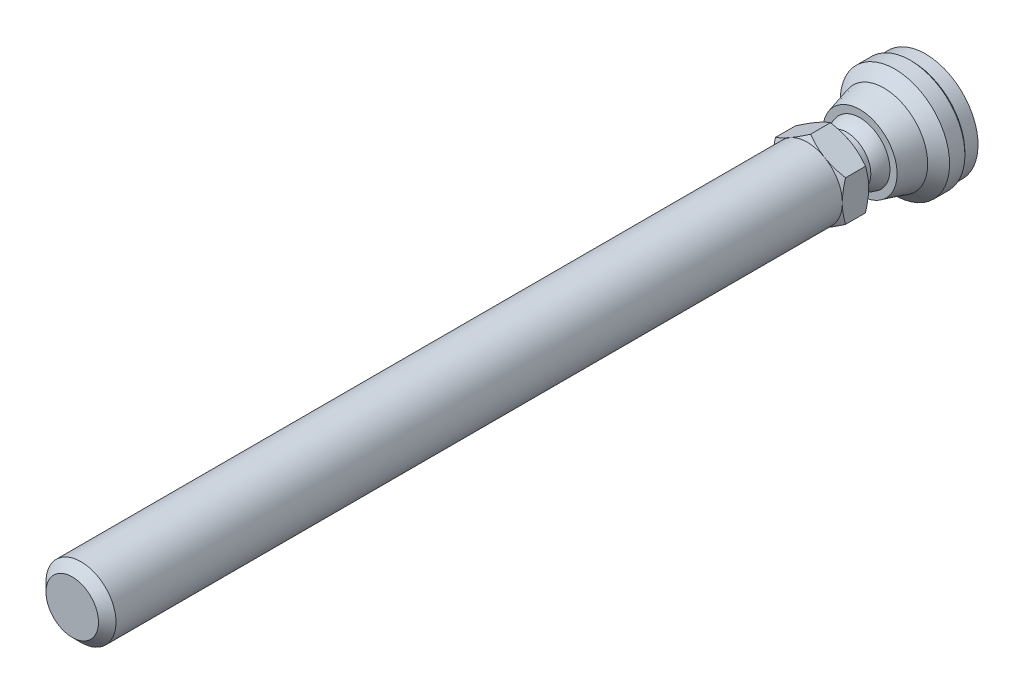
ISO-10303-21;
HEADER;
FILE_DESCRIPTION(('STEP AP214'),'2;1');
FILE_NAME('part.step','',(''),(''),'','','');
FILE_SCHEMA(('AUTOMOTIVE_DESIGN { 1 0 10303 214 1 1 1 1 }'));
ENDSEC;
DATA;
#1=APPLICATION_CONTEXT('core data for automotive mechanical design processes');
#2=APPLICATION_PROTOCOL_DEFINITION('international standard','automotive_design',2000,#1);
#3=PRODUCT_CONTEXT('',#1,'mechanical');
#4=PRODUCT('Part','Part','',(#3));
#5=PRODUCT_RELATED_PRODUCT_CATEGORY('part','',(#4));
#6=PRODUCT_DEFINITION_FORMATION('','',#4);
#7=PRODUCT_DEFINITION_CONTEXT('part definition',#1,'design');
#8=PRODUCT_DEFINITION('design','',#6,#7);
#9=PRODUCT_DEFINITION_SHAPE('','',#8);
#10=(LENGTH_UNIT() NAMED_UNIT(*) SI_UNIT(.MILLI.,.METRE.));
#11=(NAMED_UNIT(*) PLANE_ANGLE_UNIT() SI_UNIT($,.RADIAN.));
#12=(NAMED_UNIT(*) SI_UNIT($,.STERADIAN.) SOLID_ANGLE_UNIT());
#13=UNCERTAINTY_MEASURE_WITH_UNIT(LENGTH_MEASURE(1.E-05),#10,'distance_accuracy_value','');
#14=(GEOMETRIC_REPRESENTATION_CONTEXT(3) GLOBAL_UNCERTAINTY_ASSIGNED_CONTEXT((#13)) GLOBAL_UNIT_ASSIGNED_CONTEXT((#10,
#11,#12)) REPRESENTATION_CONTEXT('',''));
#15=CARTESIAN_POINT('',(0.,0.,0.));
#16=DIRECTION('',(0.,0.,1.));
#17=DIRECTION('',(1.,0.,0.));
#18=AXIS2_PLACEMENT_3D('',#15,#16,#17);
#19=CARTESIAN_POINT('',(-7.76470588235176,0.,20.9999999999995));
#20=DIRECTION('',(0.,0.,1.));
#21=DIRECTION('',(0.,-1.,0.));
#22=AXIS2_PLACEMENT_3D('',#19,#20,#21);
#23=PLANE('',#22);
#24=CARTESIAN_POINT('',(0.,0.,20.9999999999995));
#25=DIRECTION('',(0.,0.,-1.));
#26=DIRECTION('',(0.,1.,0.));
#27=AXIS2_PLACEMENT_3D('',#24,#25,#26);
#28=CIRCLE('',#27,5.5);
#29=CARTESIAN_POINT('',(0.,5.5,20.9999999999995));
#30=VERTEX_POINT('',#29);
#31=EDGE_CURVE('E293',#30,#30,#28,.T.);
#32=ORIENTED_EDGE('',*,*,#31,.F.);
#33=EDGE_LOOP('',(#32));
#34=FACE_BOUND('',#33,.T.);
#35=CARTESIAN_POINT('',(0.,0.,20.9999999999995));
#36=DIRECTION('',(0.,0.,1.));
#37=DIRECTION('',(0.,-1.,0.));
#38=AXIS2_PLACEMENT_3D('',#35,#36,#37);
#39=CIRCLE('',#38,7.99999999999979);
#40=CARTESIAN_POINT('',(-4.,-6.92820323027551,20.9999999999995));
#41=VERTEX_POINT('',#40);
#42=CARTESIAN_POINT('',(4.,-6.92820323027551,20.9999999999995));
#43=VERTEX_POINT('',#42);
#44=EDGE_CURVE('E106',#41,#43,#39,.T.);
#45=ORIENTED_EDGE('',*,*,#44,.F.);
#46=CARTESIAN_POINT('',(-8.,0.,20.9999999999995));
#47=VERTEX_POINT('',#46);
#48=EDGE_CURVE('E117',#47,#41,#39,.T.);
#49=ORIENTED_EDGE('',*,*,#48,.F.);
#50=CARTESIAN_POINT('',(-4.,6.92820323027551,20.9999999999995));
#51=VERTEX_POINT('',#50);
#52=EDGE_CURVE('E416',#51,#47,#39,.T.);
#53=ORIENTED_EDGE('',*,*,#52,.F.);
#54=CARTESIAN_POINT('',(4.,6.92820323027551,20.9999999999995));
#55=VERTEX_POINT('',#54);
#56=EDGE_CURVE('E34',#55,#51,#39,.T.);
#57=ORIENTED_EDGE('',*,*,#56,.F.);
#58=CARTESIAN_POINT('',(8.,0.,20.9999999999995));
#59=VERTEX_POINT('',#58);
#60=EDGE_CURVE('E140',#59,#55,#39,.T.);
#61=ORIENTED_EDGE('',*,*,#60,.F.);
#62=EDGE_CURVE('E119',#43,#59,#39,.T.);
#63=ORIENTED_EDGE('',*,*,#62,.F.);
#64=EDGE_LOOP('',(#45,#49,#53,#57,#61,#63));
#65=FACE_BOUND('',#64,.T.);
#66=ADVANCED_FACE('F14',(#34,#65),#23,.F.);
#67=CARTESIAN_POINT('',(0.,0.,0.));
#68=DIRECTION('',(0.,0.,-1.));
#69=DIRECTION('',(0.,1.,0.));
#70=AXIS2_PLACEMENT_3D('',#67,#68,#69);
#71=CYLINDRICAL_SURFACE('',#70,5.5);
#72=CARTESIAN_POINT('',(0.,0.,17.9999999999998));
#73=DIRECTION('',(0.,0.,-1.));
#74=DIRECTION('',(0.,1.,0.));
#75=AXIS2_PLACEMENT_3D('',#72,#73,#74);
#76=CIRCLE('',#75,5.5);
#77=CARTESIAN_POINT('',(-5.5,0.,17.9999999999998));
#78=VERTEX_POINT('',#77);
#79=EDGE_CURVE('E298',#78,#78,#76,.T.);
#80=ORIENTED_EDGE('',*,*,#79,.F.);
#81=EDGE_LOOP('',(#80));
#82=FACE_BOUND('',#81,.T.);
#83=ORIENTED_EDGE('',*,*,#31,.T.);
#84=EDGE_LOOP('',(#83));
#85=FACE_BOUND('',#84,.T.);
#86=ADVANCED_FACE('F259',(#82,#85),#71,.T.);
#87=CARTESIAN_POINT('',(0.,0.,13.6698729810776));
#88=DIRECTION('',(0.,0.,-1.));
#89=DIRECTION('',(-1.,0.,0.));
#90=AXIS2_PLACEMENT_3D('',#87,#88,#89);
#91=SPHERICAL_SURFACE('',#90,7.);
#92=CARTESIAN_POINT('',(0.,0.,14.9999999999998));
#93=DIRECTION('',(0.,0.,-1.));
#94=DIRECTION('',(0.,1.,0.));
#95=AXIS2_PLACEMENT_3D('',#92,#93,#94);
#96=CIRCLE('',#95,6.87246404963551);
#97=CARTESIAN_POINT('',(-6.87246404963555,0.,14.9999999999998));
#98=VERTEX_POINT('',#97);
#99=EDGE_CURVE('E301',#98,#98,#96,.T.);
#100=CARTESIAN_POINT('',(-6.87246404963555,0.,14.9999999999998));
#101=CARTESIAN_POINT('',(-6.86587210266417,0.,15.0340591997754));
#102=CARTESIAN_POINT('',(-6.85902692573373,0.,15.0680693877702));
#103=CARTESIAN_POINT('',(-6.8448317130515,0.,15.1359842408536));
#104=CARTESIAN_POINT('',(-6.83748167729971,0.,15.1698889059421));
#105=CARTESIAN_POINT('',(-6.82227834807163,0.,15.2375852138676));
#106=CARTESIAN_POINT('',(-6.81442505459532,0.,15.2713768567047));
#107=CARTESIAN_POINT('',(-6.79821695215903,0.,15.3388396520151));
#108=CARTESIAN_POINT('',(-6.78986214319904,0.,15.3725108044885));
#109=CARTESIAN_POINT('',(-6.77265285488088,0.,15.4397251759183));
#110=CARTESIAN_POINT('',(-6.76379837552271,0.,15.4732683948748));
#111=CARTESIAN_POINT('',(-6.7455917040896,0.,15.5402194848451));
#112=CARTESIAN_POINT('',(-6.73623951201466,0.,15.5736273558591));
#113=CARTESIAN_POINT('',(-6.71703948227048,0.,15.6403003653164));
#114=CARTESIAN_POINT('',(-6.70719164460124,0.,15.6735655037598));
#115=CARTESIAN_POINT('',(-6.68700250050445,0.,15.7399456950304));
#116=CARTESIAN_POINT('',(-6.6766611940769,0.,15.7730607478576));
#117=CARTESIAN_POINT('',(-6.65548739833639,0.,15.839133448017));
#118=CARTESIAN_POINT('',(-6.64465490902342,0.,15.8720910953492));
#119=CARTESIAN_POINT('',(-6.62250114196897,0.,15.9378416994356));
#120=CARTESIAN_POINT('',(-6.61117986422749,0.,15.9706346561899));
#121=CARTESIAN_POINT('',(-6.58805102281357,0.,16.0360486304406));
#122=CARTESIAN_POINT('',(-6.57624345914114,0.,16.0686696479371));
#123=CARTESIAN_POINT('',(-6.55214465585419,0.,16.133732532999));
#124=CARTESIAN_POINT('',(-6.53985341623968,0.,16.1661744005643));
#125=CARTESIAN_POINT('',(-6.51478997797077,0.,16.2308718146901));
#126=CARTESIAN_POINT('',(-6.50201777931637,0.,16.2631273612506));
#127=CARTESIAN_POINT('',(-6.475995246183,0.,16.3274450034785));
#128=CARTESIAN_POINT('',(-6.46274491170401,0.,16.3595070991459));
#129=CARTESIAN_POINT('',(-6.43576903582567,0.,16.42343075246));
#130=CARTESIAN_POINT('',(-6.42204349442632,0.,16.4552923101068));
#131=CARTESIAN_POINT('',(-6.39412023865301,0.,16.5188078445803));
#132=CARTESIAN_POINT('',(-6.37992252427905,0.,16.5504618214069));
#133=CARTESIAN_POINT('',(-6.35105806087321,0.,16.6135551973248));
#134=CARTESIAN_POINT('',(-6.33639131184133,0.,16.6449945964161));
#135=CARTESIAN_POINT('',(-6.3065920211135,0.,16.7076518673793));
#136=CARTESIAN_POINT('',(-6.29145947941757,0.,16.7388697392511));
#137=CARTESIAN_POINT('',(-6.2607319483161,0.,16.8010770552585));
#138=CARTESIAN_POINT('',(-6.24513695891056,0.,16.832066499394));
#139=CARTESIAN_POINT('',(-6.21348797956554,0.,16.8938101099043));
#140=CARTESIAN_POINT('',(-6.19743398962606,0.,16.9245642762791));
#141=CARTESIAN_POINT('',(-6.16487055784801,0.,16.9858305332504));
#142=CARTESIAN_POINT('',(-6.14836111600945,0.,17.0163426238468));
#143=CARTESIAN_POINT('',(-6.11489042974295,0.,17.077117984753));
#144=CARTESIAN_POINT('',(-6.09792918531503,0.,17.1073812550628));
#145=CARTESIAN_POINT('',(-6.06355864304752,0.,17.1676522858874));
#146=CARTESIAN_POINT('',(-6.04614934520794,0.,17.1976600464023));
#147=CARTESIAN_POINT('',(-6.01088654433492,0.,17.2574134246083));
#148=CARTESIAN_POINT('',(-5.99303304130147,0.,17.2871590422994));
#149=CARTESIAN_POINT('',(-5.95688577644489,0.,17.346381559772));
#150=CARTESIAN_POINT('',(-5.93859201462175,0.,17.3758584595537));
#151=CARTESIAN_POINT('',(-5.90156827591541,0.,17.434537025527));
#152=CARTESIAN_POINT('',(-5.88283829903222,0.,17.4637386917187));
#153=CARTESIAN_POINT('',(-5.84494627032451,0.,17.5218603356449));
#154=CARTESIAN_POINT('',(-5.82578421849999,0.,17.5507803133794));
#155=CARTESIAN_POINT('',(-5.78703227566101,0.,17.608332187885));
#156=CARTESIAN_POINT('',(-5.76744238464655,0.,17.636964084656));
#157=CARTESIAN_POINT('',(-5.72783909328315,0.,17.6939334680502));
#158=CARTESIAN_POINT('',(-5.70782569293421,0.,17.7222709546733));
#159=CARTESIAN_POINT('',(-5.66737980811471,0.,17.7786452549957));
#160=CARTESIAN_POINT('',(-5.64694732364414,0.,17.8066820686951));
#161=CARTESIAN_POINT('',(-5.60566778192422,0.,17.8624488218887));
#162=CARTESIAN_POINT('',(-5.58482072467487,0.,17.890178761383));
#163=CARTESIAN_POINT('',(-5.54271666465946,0.,17.9453256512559));
#164=CARTESIAN_POINT('',(-5.5214596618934,0.,17.9727426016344));
#165=CARTESIAN_POINT('',(-5.5,0.,17.9999999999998));
#166=B_SPLINE_CURVE_WITH_KNOTS('',3,(#100,#101,#102,#103,#104,#105,#106,#107,#108,#109,#110,
#111,#112,#113,#114,#115,#116,#117,#118,#119,#120,#121,#122,#123,#124,#125,#126,#127,#128,#129,
#130,#131,#132,#133,#134,#135,#136,#137,#138,#139,#140,#141,#142,#143,#144,#145,#146,#147,#148,
#149,#150,#151,#152,#153,#154,#155,#156,#157,#158,#159,#160,#161,#162,#163,#164,#165),
.UNSPECIFIED.,.F.,.F.,(4,2,2,2,2,2,2,2,2,2,2,2,2,2,2,2,2,2,2,2,2,2,2,2,2,2,2,2,2,2,2,2,4),(0.,
0.104072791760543,0.208145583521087,0.31221837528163,0.416291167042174,0.520363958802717,
0.624436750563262,0.728509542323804,0.832582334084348,0.936655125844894,1.04072791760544,
1.14480070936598,1.24887350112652,1.35294629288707,1.45701908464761,1.56109187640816,
1.6651646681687,1.76923745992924,1.87331025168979,1.97738304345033,2.08145583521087,
2.18552862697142,2.28960141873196,2.3936742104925,2.49774700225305,2.60181979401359,
2.70589258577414,2.80996537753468,2.91403816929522,3.01811096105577,3.12218375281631,
3.22625654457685,3.3303293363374),.UNSPECIFIED.);
#167=EDGE_CURVE('BSEAM255',#98,#78,#166,.T.);
#168=ORIENTED_EDGE('',*,*,#99,.F.);
#169=ORIENTED_EDGE('',*,*,#79,.T.);
#170=ORIENTED_EDGE('',*,*,#167,.T.);
#171=ORIENTED_EDGE('',*,*,#167,.F.);
#172=EDGE_LOOP('',(#168,#170,#169,#171));
#173=FACE_BOUND('',#172,.T.);
#174=ADVANCED_FACE('F255',(#173),#91,.T.);
#175=CARTESIAN_POINT('',(-8.5,0.,14.9999999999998));
#176=DIRECTION('',(0.,0.,-1.));
#177=DIRECTION('',(0.,1.,0.));
#178=AXIS2_PLACEMENT_3D('',#175,#176,#177);
#179=PLANE('',#178);
#180=CARTESIAN_POINT('',(0.,0.,14.9999999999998));
#181=DIRECTION('',(0.,0.,-1.));
#182=DIRECTION('',(0.,1.,0.));
#183=AXIS2_PLACEMENT_3D('',#180,#181,#182);
#184=CIRCLE('',#183,8.5);
#185=CARTESIAN_POINT('',(0.,8.5,14.9999999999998));
#186=VERTEX_POINT('',#185);
#187=EDGE_CURVE('E304',#186,#186,#184,.T.);
#188=ORIENTED_EDGE('',*,*,#187,.F.);
#189=EDGE_LOOP('',(#188));
#190=FACE_BOUND('',#189,.T.);
#191=ORIENTED_EDGE('',*,*,#99,.T.);
#192=EDGE_LOOP('',(#191));
#193=FACE_BOUND('',#192,.T.);
#194=ADVANCED_FACE('F251',(#190,#193),#179,.F.);
#195=CARTESIAN_POINT('',(0.,0.,14.9999999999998));
#196=DIRECTION('',(0.,0.,-1.));
#197=DIRECTION('',(0.,1.,0.));
#198=AXIS2_PLACEMENT_3D('',#195,#196,#197);
#199=CONICAL_SURFACE('',#198,8.5,0.266252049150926);
#200=CARTESIAN_POINT('',(0.,0.,9.49999999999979));
#201=DIRECTION('',(0.,0.,-1.));
#202=DIRECTION('',(0.,1.,0.));
#203=AXIS2_PLACEMENT_3D('',#200,#201,#202);
#204=CIRCLE('',#203,10.);
#205=CARTESIAN_POINT('',(0.,10.,9.49999999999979));
#206=VERTEX_POINT('',#205);
#207=EDGE_CURVE('E307',#206,#206,#204,.T.);
#208=ORIENTED_EDGE('',*,*,#207,.F.);
#209=EDGE_LOOP('',(#208));
#210=FACE_BOUND('',#209,.T.);
#211=ORIENTED_EDGE('',*,*,#187,.T.);
#212=EDGE_LOOP('',(#211));
#213=FACE_BOUND('',#212,.T.);
#214=ADVANCED_FACE('F247',(#210,#213),#199,.T.);
#215=CARTESIAN_POINT('',(0.,0.,9.49999999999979));
#216=DIRECTION('',(0.,0.,-1.));
#217=DIRECTION('',(0.,1.,0.));
#218=AXIS2_PLACEMENT_3D('',#215,#216,#217);
#219=CONICAL_SURFACE('',#218,10.,0.785398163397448);
#220=CARTESIAN_POINT('',(0.,0.,6.99999999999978));
#221=DIRECTION('',(0.,0.,-1.));
#222=DIRECTION('',(0.,1.,0.));
#223=AXIS2_PLACEMENT_3D('',#220,#221,#222);
#224=CIRCLE('',#223,12.5);
#225=CARTESIAN_POINT('',(0.,12.5,6.99999999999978));
#226=VERTEX_POINT('',#225);
#227=EDGE_CURVE('E310',#226,#226,#224,.T.);
#228=ORIENTED_EDGE('',*,*,#227,.F.);
#229=EDGE_LOOP('',(#228));
#230=FACE_BOUND('',#229,.T.);
#231=ORIENTED_EDGE('',*,*,#207,.T.);
#232=EDGE_LOOP('',(#231));
#233=FACE_BOUND('',#232,.T.);
#234=ADVANCED_FACE('F243',(#230,#233),#219,.T.);
#235=CARTESIAN_POINT('',(0.,0.,0.));
#236=DIRECTION('',(0.,0.,-1.));
#237=DIRECTION('',(0.,1.,0.));
#238=AXIS2_PLACEMENT_3D('',#235,#236,#237);
#239=CYLINDRICAL_SURFACE('',#238,12.5);
#240=CARTESIAN_POINT('',(0.,0.,3.49999999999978));
#241=DIRECTION('',(0.,0.,-1.));
#242=DIRECTION('',(0.,1.,0.));
#243=AXIS2_PLACEMENT_3D('',#240,#241,#242);
#244=CIRCLE('',#243,12.5);
#245=CARTESIAN_POINT('',(0.,12.5,3.49999999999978));
#246=VERTEX_POINT('',#245);
#247=EDGE_CURVE('E313',#246,#246,#244,.T.);
#248=ORIENTED_EDGE('',*,*,#247,.F.);
#249=EDGE_LOOP('',(#248));
#250=FACE_BOUND('',#249,.T.);
#251=ORIENTED_EDGE('',*,*,#227,.T.);
#252=EDGE_LOOP('',(#251));
#253=FACE_BOUND('',#252,.T.);
#254=ADVANCED_FACE('F239',(#250,#253),#239,.T.);
#255=CARTESIAN_POINT('',(0.,0.,3.49999999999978));
#256=DIRECTION('',(0.,0.,1.));
#257=DIRECTION('',(0.,-1.,0.));
#258=AXIS2_PLACEMENT_3D('',#255,#256,#257);
#259=CONICAL_SURFACE('',#258,12.5,0.785398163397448);
#260=CARTESIAN_POINT('',(0.,0.,2.99999999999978));
#261=DIRECTION('',(0.,0.,-1.));
#262=DIRECTION('',(0.,1.,0.));
#263=AXIS2_PLACEMENT_3D('',#260,#261,#262);
#264=CIRCLE('',#263,12.);
#265=CARTESIAN_POINT('',(0.,12.,2.99999999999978));
#266=VERTEX_POINT('',#265);
#267=EDGE_CURVE('E316',#266,#266,#264,.T.);
#268=ORIENTED_EDGE('',*,*,#267,.F.);
#269=EDGE_LOOP('',(#268));
#270=FACE_BOUND('',#269,.T.);
#271=ORIENTED_EDGE('',*,*,#247,.T.);
#272=EDGE_LOOP('',(#271));
#273=FACE_BOUND('',#272,.T.);
#274=ADVANCED_FACE('F235',(#270,#273),#259,.T.);
#275=CARTESIAN_POINT('',(0.,0.,0.));
#276=DIRECTION('',(0.,0.,-1.));
#277=DIRECTION('',(0.,1.,0.));
#278=AXIS2_PLACEMENT_3D('',#275,#276,#277);
#279=CYLINDRICAL_SURFACE('',#278,12.);
#280=CARTESIAN_POINT('',(0.,0.,0.));
#281=DIRECTION('',(0.,0.,-1.));
#282=DIRECTION('',(0.,1.,0.));
#283=AXIS2_PLACEMENT_3D('',#280,#281,#282);
#284=CIRCLE('',#283,12.);
#285=CARTESIAN_POINT('',(0.,12.,0.));
#286=VERTEX_POINT('',#285);
#287=EDGE_CURVE('E319',#286,#286,#284,.T.);
#288=ORIENTED_EDGE('',*,*,#287,.F.);
#289=EDGE_LOOP('',(#288));
#290=FACE_BOUND('',#289,.T.);
#291=ORIENTED_EDGE('',*,*,#267,.T.);
#292=EDGE_LOOP('',(#291));
#293=FACE_BOUND('',#292,.T.);
#294=ADVANCED_FACE('F231',(#290,#293),#279,.T.);
#295=CARTESIAN_POINT('',(-12.,0.,0.));
#296=DIRECTION('',(0.,0.,1.));
#297=DIRECTION('',(0.,-1.,0.));
#298=AXIS2_PLACEMENT_3D('',#295,#296,#297);
#299=PLANE('',#298);
#300=ORIENTED_EDGE('',*,*,#287,.T.);
#301=EDGE_LOOP('',(#300));
#302=FACE_BOUND('',#301,.T.);
#303=ADVANCED_FACE('F163',(#302),#299,.F.);
#304=CARTESIAN_POINT('',(0.,0.,20.9999999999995));
#305=DIRECTION('',(0.,0.,1.));
#306=DIRECTION('',(0.,-1.,0.));
#307=AXIS2_PLACEMENT_3D('',#304,#305,#306);
#308=CONICAL_SURFACE('',#307,7.99999999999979,1.0471975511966);
#309=CARTESIAN_POINT('',(8.,12.4050563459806,24.9034319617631));
#310=CARTESIAN_POINT('',(8.,12.0556644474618,24.7339520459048));
#311=CARTESIAN_POINT('',(8.,11.7054703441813,24.5660976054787));
#312=CARTESIAN_POINT('',(8.,11.003051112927,24.2345538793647));
#313=CARTESIAN_POINT('',(8.,10.6508256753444,24.0708652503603));
#314=CARTESIAN_POINT('',(8.,9.9421015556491,23.7477434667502));
#315=CARTESIAN_POINT('',(8.,9.58559004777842,23.5883383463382));
#316=CARTESIAN_POINT('',(8.,8.86973105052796,23.2760533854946));
#317=CARTESIAN_POINT('',(8.,8.51038369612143,23.1231732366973));
#318=CARTESIAN_POINT('',(8.,7.77667311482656,22.8208782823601));
#319=CARTESIAN_POINT('',(8.,7.40219838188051,22.6717326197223));
#320=CARTESIAN_POINT('',(8.,6.64886807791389,22.3847330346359));
#321=CARTESIAN_POINT('',(8.,6.27001202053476,22.246880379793));
#322=CARTESIAN_POINT('',(8.,5.50802143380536,21.9860873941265));
#323=CARTESIAN_POINT('',(8.,5.12489735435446,21.8631168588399));
#324=CARTESIAN_POINT('',(8.,4.35316712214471,21.6360335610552));
#325=CARTESIAN_POINT('',(8.,3.96456273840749,21.5319148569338));
#326=CARTESIAN_POINT('',(8.,3.18375168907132,21.3480957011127));
#327=CARTESIAN_POINT('',(8.,2.79157716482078,21.2682624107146));
#328=CARTESIAN_POINT('',(8.,2.19974527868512,21.1701815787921));
#329=CARTESIAN_POINT('',(8.,2.00185838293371,21.1410981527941));
#330=CARTESIAN_POINT('',(8.,1.6051015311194,21.0907248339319));
#331=CARTESIAN_POINT('',(8.,1.40623167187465,21.0694341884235));
#332=CARTESIAN_POINT('',(8.,1.01037227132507,21.0353375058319));
#333=CARTESIAN_POINT('',(8.,0.813391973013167,21.0224245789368));
#334=CARTESIAN_POINT('',(8.,0.419061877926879,21.0049399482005));
#335=CARTESIAN_POINT('',(8.,0.221712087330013,21.0003681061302));
#336=CARTESIAN_POINT('',(8.,-0.173004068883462,20.999674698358));
#337=CARTESIAN_POINT('',(8.,-0.370370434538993,21.0035531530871));
#338=CARTESIAN_POINT('',(8.,-0.764764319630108,21.0196655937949));
#339=CARTESIAN_POINT('',(8.,-0.961791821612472,21.0318999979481));
#340=CARTESIAN_POINT('',(8.,-1.43536851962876,21.0710903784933));
#341=CARTESIAN_POINT('',(8.,-1.71159626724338,21.1020143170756));
#342=CARTESIAN_POINT('',(8.,-2.261987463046,21.1785984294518));
#343=CARTESIAN_POINT('',(8.,-2.53615062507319,21.2242606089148));
#344=CARTESIAN_POINT('',(8.,-3.35523867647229,21.3809320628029));
#345=CARTESIAN_POINT('',(8.,-3.89645282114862,21.5115972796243));
#346=CARTESIAN_POINT('',(8.,-4.70568356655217,21.7380031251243));
#347=CARTESIAN_POINT('',(8.,-4.97790253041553,21.819585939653));
#348=CARTESIAN_POINT('',(8.,-5.51969632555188,21.991181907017));
#349=CARTESIAN_POINT('',(8.,-5.78927113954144,22.0811951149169));
#350=CARTESIAN_POINT('',(8.,-6.32586197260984,22.2682112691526));
#351=CARTESIAN_POINT('',(8.,-6.59287881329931,22.3652118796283));
#352=CARTESIAN_POINT('',(8.,-7.12470339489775,22.5650658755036));
#353=CARTESIAN_POINT('',(8.,-7.38951116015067,22.6679191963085));
#354=CARTESIAN_POINT('',(8.,-8.00803307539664,22.9147730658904));
#355=CARTESIAN_POINT('',(8.,-8.36095869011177,23.0607455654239));
#356=CARTESIAN_POINT('',(8.,-9.06385291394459,23.3596643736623));
#357=CARTESIAN_POINT('',(8.,-9.41382134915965,23.5126110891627));
#358=CARTESIAN_POINT('',(8.,-10.1113428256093,23.8241003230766));
#359=CARTESIAN_POINT('',(8.,-10.4588953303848,23.9826440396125));
#360=CARTESIAN_POINT('',(8.,-11.15190689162,24.304213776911));
#361=CARTESIAN_POINT('',(8.,-11.4973659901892,24.4672397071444));
#362=CARTESIAN_POINT('',(8.,-12.186899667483,24.7971199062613));
#363=CARTESIAN_POINT('',(8.,-12.5309723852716,24.9639780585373));
#364=CARTESIAN_POINT('',(8.,-13.2176390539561,25.3007126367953));
#365=CARTESIAN_POINT('',(8.,-13.5602329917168,25.4705890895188));
#366=CARTESIAN_POINT('',(8.,-14.5860573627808,25.9839085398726));
#367=CARTESIAN_POINT('',(8.,-15.2674195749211,26.3310846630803));
#368=CARTESIAN_POINT('',(8.,-16.5704927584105,27.00355725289));
#369=CARTESIAN_POINT('',(8.,-17.19249150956,27.3282985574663));
#370=CARTESIAN_POINT('',(8.,-18.4341583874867,27.982254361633));
#371=CARTESIAN_POINT('',(7.99999999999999,-19.0538264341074,28.3114690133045));
#372=CARTESIAN_POINT('',(7.99999999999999,-20.2898281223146,28.9725032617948));
#373=CARTESIAN_POINT('',(7.99999999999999,-20.9061662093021,29.3043145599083));
#374=CARTESIAN_POINT('',(7.99999999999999,-22.137348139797,29.9706198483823));
#375=CARTESIAN_POINT('',(8.,-22.7521920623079,30.3051136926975));
#376=CARTESIAN_POINT('',(8.,-23.3664842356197,30.6406109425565));
#377=B_SPLINE_CURVE_WITH_KNOTS('',3,(#309,#310,#311,#312,#313,#314,#315,#316,#317,#318,#319,
#320,#321,#322,#323,#324,#325,#326,#327,#328,#329,#330,#331,#332,#333,#334,#335,#336,#337,#338,
#339,#340,#341,#342,#343,#344,#345,#346,#347,#348,#349,#350,#351,#352,#353,#354,#355,#356,#357,
#358,#359,#360,#361,#362,#363,#364,#365,#366,#367,#368,#369,#370,#371,#372,#373,#374,#375,#376),
.UNSPECIFIED.,.F.,.F.,(4,2,2,2,2,2,2,2,2,2,2,2,2,2,2,2,2,2,2,2,2,2,2,2,2,2,2,2,2,2,2,2,2,4),(0.,
1.16499631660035,2.33017515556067,3.50170034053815,4.67317009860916,5.88227720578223,
7.09151984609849,8.29826553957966,9.50463023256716,10.7042723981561,11.3041811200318,
11.9040318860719,12.4960703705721,13.0880990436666,13.6801291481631,14.2721888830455,
15.1055778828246,15.9390803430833,17.6070130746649,18.4594858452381,19.3119641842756,
20.1641588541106,21.0163441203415,22.1620100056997,23.3077428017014,24.4537223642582,
25.5996787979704,26.7468527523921,27.8940368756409,30.1881079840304,32.2930954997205,
34.3981547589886,36.4980863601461,38.5979044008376),.UNSPECIFIED.);
#378=CARTESIAN_POINT('',(8.,4.61880215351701,21.714531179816));
#379=VERTEX_POINT('',#378);
#380=EDGE_CURVE('E141',#379,#59,#377,.T.);
#381=ORIENTED_EDGE('',*,*,#380,.T.);
#382=ORIENTED_EDGE('',*,*,#60,.T.);
#383=CARTESIAN_POINT('',(-0.000199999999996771,9.23771977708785,21.7145978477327));
#384=CARTESIAN_POINT('',(0.175648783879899,9.13619343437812,21.655990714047));
#385=CARTESIAN_POINT('',(0.352153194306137,9.03428856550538,21.600043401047));
#386=CARTESIAN_POINT('',(0.706595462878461,8.82965122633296,21.4942010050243));
#387=CARTESIAN_POINT('',(0.884533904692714,8.72691841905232,21.4443085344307));
#388=CARTESIAN_POINT('',(1.42119823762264,8.41707512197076,21.3046927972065));
#389=CARTESIAN_POINT('',(1.78204258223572,8.20874154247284,21.225281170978));
#390=CARTESIAN_POINT('',(2.32203917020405,7.89697436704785,21.1321616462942));
#391=CARTESIAN_POINT('',(2.49957818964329,7.79447216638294,21.1056345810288));
#392=CARTESIAN_POINT('',(2.8554591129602,7.58900421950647,21.0611531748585));
#393=CARTESIAN_POINT('',(3.03380094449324,7.4860385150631,21.0431980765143));
#394=CARTESIAN_POINT('',(3.39079168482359,7.27992981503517,21.0163156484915));
#395=CARTESIAN_POINT('',(3.5694400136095,7.17678715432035,21.0073780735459));
#396=CARTESIAN_POINT('',(3.92690170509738,6.97040655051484,20.9987223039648));
#397=CARTESIAN_POINT('',(4.10571506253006,6.86716861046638,20.9990038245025));
#398=CARTESIAN_POINT('',(4.4400133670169,6.67416139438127,21.0081450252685));
#399=CARTESIAN_POINT('',(4.59552190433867,6.58437849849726,21.015889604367));
#400=CARTESIAN_POINT('',(4.90617476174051,6.40502298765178,21.0382011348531));
#401=CARTESIAN_POINT('',(5.06131905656,6.31545038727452,21.0527685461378));
#402=CARTESIAN_POINT('',(5.52615131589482,6.04707935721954,21.1063606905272));
#403=CARTESIAN_POINT('',(5.83501648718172,5.86875596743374,21.1552686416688));
#404=CARTESIAN_POINT('',(6.4560232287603,5.51021755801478,21.277539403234));
#405=CARTESIAN_POINT('',(6.76808554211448,5.33004829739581,21.3514205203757));
#406=CARTESIAN_POINT('',(7.38755648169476,4.97239658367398,21.5191001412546));
#407=CARTESIAN_POINT('',(7.69497304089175,4.79490955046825,21.6128592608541));
#408=CARTESIAN_POINT('',(8.0002,4.61868668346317,21.7145978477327));
#409=B_SPLINE_CURVE_WITH_KNOTS('',3,(#383,#384,#385,#386,#387,#388,#389,#390,#391,#392,#393,
#394,#395,#396,#397,#398,#399,#400,#401,#402,#403,#404,#405,#406,#407,#408),.UNSPECIFIED.,.F.,
.F.,(4,2,2,2,2,2,2,2,2,2,2,2,4),(0.,0.63397354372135,1.26821965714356,2.53934712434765,
3.15934343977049,3.77928496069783,4.39852133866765,5.01773858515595,5.55680239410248,
6.09590254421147,7.17487077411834,8.27776850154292,9.37850115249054),.UNSPECIFIED.);
#410=EDGE_CURVE('E18',#55,#379,#409,.T.);
#411=ORIENTED_EDGE('',*,*,#410,.T.);
#412=EDGE_LOOP('',(#381,#382,#411));
#413=FACE_BOUND('',#412,.T.);
#414=ADVANCED_FACE('F158',(#413),#308,.T.);
#415=CARTESIAN_POINT('',(-8.0002,4.61868668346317,21.7145978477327));
#416=CARTESIAN_POINT('',(-7.8243512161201,4.7202130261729,21.655990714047));
#417=CARTESIAN_POINT('',(-7.64784680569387,4.82211789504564,21.600043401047));
#418=CARTESIAN_POINT('',(-7.29340453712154,5.02675523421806,21.4942010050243));
#419=CARTESIAN_POINT('',(-7.11546609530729,5.1294880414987,21.4443085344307));
#420=CARTESIAN_POINT('',(-6.57880176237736,5.43933133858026,21.3046927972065));
#421=CARTESIAN_POINT('',(-6.21795741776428,5.64766491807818,21.225281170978));
#422=CARTESIAN_POINT('',(-5.67796082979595,5.95943209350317,21.1321616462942));
#423=CARTESIAN_POINT('',(-5.50042181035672,6.06193429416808,21.1056345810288));
#424=CARTESIAN_POINT('',(-5.1445408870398,6.26740224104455,21.0611531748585));
#425=CARTESIAN_POINT('',(-4.96619905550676,6.37036794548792,21.0431980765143));
#426=CARTESIAN_POINT('',(-4.60920831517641,6.57647664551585,21.0163156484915));
#427=CARTESIAN_POINT('',(-4.4305599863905,6.67961930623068,21.0073780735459));
#428=CARTESIAN_POINT('',(-4.07309829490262,6.88599991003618,20.9987223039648));
#429=CARTESIAN_POINT('',(-3.89428493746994,6.98923785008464,20.9990038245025));
#430=CARTESIAN_POINT('',(-3.5599866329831,7.18224506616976,21.0081450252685));
#431=CARTESIAN_POINT('',(-3.40447809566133,7.27202796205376,21.015889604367));
#432=CARTESIAN_POINT('',(-3.09382523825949,7.45138347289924,21.0382011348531));
#433=CARTESIAN_POINT('',(-2.93868094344,7.54095607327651,21.0527685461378));
#434=CARTESIAN_POINT('',(-2.47384868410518,7.80932710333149,21.1063606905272));
#435=CARTESIAN_POINT('',(-2.16498351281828,7.98765049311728,21.1552686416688));
#436=CARTESIAN_POINT('',(-1.5439767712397,8.34618890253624,21.277539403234));
#437=CARTESIAN_POINT('',(-1.23191445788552,8.52635816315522,21.3514205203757));
#438=CARTESIAN_POINT('',(-0.612443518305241,8.88400987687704,21.5191001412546));
#439=CARTESIAN_POINT('',(-0.305026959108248,9.06149691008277,21.6128592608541));
#440=CARTESIAN_POINT('',(0.000200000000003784,9.23771977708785,21.7145978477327));
#441=B_SPLINE_CURVE_WITH_KNOTS('',3,(#415,#416,#417,#418,#419,#420,#421,#422,#423,#424,#425,
#426,#427,#428,#429,#430,#431,#432,#433,#434,#435,#436,#437,#438,#439,#440),.UNSPECIFIED.,.F.,
.F.,(4,2,2,2,2,2,2,2,2,2,2,2,4),(0.,0.633973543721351,1.26821965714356,2.53934712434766,
3.15934343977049,3.77928496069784,4.39852133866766,5.01773858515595,5.55680239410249,
6.09590254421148,7.17487077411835,8.27776850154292,9.37850115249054),.UNSPECIFIED.);
#442=CARTESIAN_POINT('',(0.,9.23760430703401,21.714531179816));
#443=VERTEX_POINT('',#442);
#444=EDGE_CURVE('E142',#51,#443,#441,.T.);
#445=ORIENTED_EDGE('',*,*,#444,.T.);
#446=EDGE_CURVE('E9',#443,#55,#409,.T.);
#447=ORIENTED_EDGE('',*,*,#446,.T.);
#448=ORIENTED_EDGE('',*,*,#56,.T.);
#449=EDGE_LOOP('',(#445,#447,#448));
#450=FACE_BOUND('',#449,.T.);
#451=ADVANCED_FACE('F162',(#450),#308,.T.);
#452=CARTESIAN_POINT('',(8.0002,-4.61868668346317,21.7145978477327));
#453=CARTESIAN_POINT('',(7.8243512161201,-4.7202130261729,21.655990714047));
#454=CARTESIAN_POINT('',(7.64784680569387,-4.82211789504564,21.600043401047));
#455=CARTESIAN_POINT('',(7.29340453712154,-5.02675523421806,21.4942010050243));
#456=CARTESIAN_POINT('',(7.11546609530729,-5.1294880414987,21.4443085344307));
#457=CARTESIAN_POINT('',(6.57880176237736,-5.43933133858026,21.3046927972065));
#458=CARTESIAN_POINT('',(6.21795741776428,-5.64766491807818,21.225281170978));
#459=CARTESIAN_POINT('',(5.67796082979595,-5.95943209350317,21.1321616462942));
#460=CARTESIAN_POINT('',(5.50042181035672,-6.06193429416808,21.1056345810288));
#461=CARTESIAN_POINT('',(5.1445408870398,-6.26740224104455,21.0611531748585));
#462=CARTESIAN_POINT('',(4.96619905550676,-6.37036794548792,21.0431980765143));
#463=CARTESIAN_POINT('',(4.60920831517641,-6.57647664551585,21.0163156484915));
#464=CARTESIAN_POINT('',(4.4305599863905,-6.67961930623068,21.0073780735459));
#465=CARTESIAN_POINT('',(4.07309829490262,-6.88599991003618,20.9987223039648));
#466=CARTESIAN_POINT('',(3.89428493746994,-6.98923785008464,20.9990038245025));
#467=CARTESIAN_POINT('',(3.5599866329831,-7.18224506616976,21.0081450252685));
#468=CARTESIAN_POINT('',(3.40447809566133,-7.27202796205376,21.015889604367));
#469=CARTESIAN_POINT('',(3.09382523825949,-7.45138347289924,21.0382011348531));
#470=CARTESIAN_POINT('',(2.93868094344,-7.54095607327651,21.0527685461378));
#471=CARTESIAN_POINT('',(2.47384868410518,-7.80932710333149,21.1063606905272));
#472=CARTESIAN_POINT('',(2.16498351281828,-7.98765049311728,21.1552686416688));
#473=CARTESIAN_POINT('',(1.5439767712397,-8.34618890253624,21.277539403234));
#474=CARTESIAN_POINT('',(1.23191445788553,-8.52635816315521,21.3514205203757));
#475=CARTESIAN_POINT('',(0.612443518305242,-8.88400987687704,21.5191001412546));
#476=CARTESIAN_POINT('',(0.30502695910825,-9.06149691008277,21.6128592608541));
#477=CARTESIAN_POINT('',(-0.000200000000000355,-9.23771977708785,21.7145978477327));
#478=B_SPLINE_CURVE_WITH_KNOTS('',3,(#452,#453,#454,#455,#456,#457,#458,#459,#460,#461,#462,
#463,#464,#465,#466,#467,#468,#469,#470,#471,#472,#473,#474,#475,#476,#477),.UNSPECIFIED.,.F.,
.F.,(4,2,2,2,2,2,2,2,2,2,2,2,4),(0.,0.633973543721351,1.26821965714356,2.53934712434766,
3.15934343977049,3.77928496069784,4.39852133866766,5.01773858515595,5.55680239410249,
6.09590254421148,7.17487077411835,8.27776850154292,9.37850115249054),.UNSPECIFIED.);
#479=CARTESIAN_POINT('',(8.,-4.61880215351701,21.714531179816));
#480=VERTEX_POINT('',#479);
#481=EDGE_CURVE('E122',#480,#43,#478,.T.);
#482=ORIENTED_EDGE('',*,*,#481,.T.);
#483=ORIENTED_EDGE('',*,*,#62,.T.);
#484=EDGE_CURVE('E126',#59,#480,#377,.T.);
#485=ORIENTED_EDGE('',*,*,#484,.T.);
#486=EDGE_LOOP('',(#482,#483,#485));
#487=FACE_BOUND('',#486,.T.);
#488=ADVANCED_FACE('F123',(#487),#308,.T.);
#489=CARTESIAN_POINT('',(0.000200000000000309,-9.23771977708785,21.7145978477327));
#490=CARTESIAN_POINT('',(-0.175648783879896,-9.13619343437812,21.655990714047));
#491=CARTESIAN_POINT('',(-0.352153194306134,-9.03428856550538,21.600043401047));
#492=CARTESIAN_POINT('',(-0.706595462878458,-8.82965122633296,21.4942010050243));
#493=CARTESIAN_POINT('',(-0.88453390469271,-8.72691841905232,21.4443085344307));
#494=CARTESIAN_POINT('',(-1.42119823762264,-8.41707512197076,21.3046927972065));
#495=CARTESIAN_POINT('',(-1.78204258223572,-8.20874154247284,21.225281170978));
#496=CARTESIAN_POINT('',(-2.32203917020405,-7.89697436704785,21.1321616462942));
#497=CARTESIAN_POINT('',(-2.49957818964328,-7.79447216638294,21.1056345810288));
#498=CARTESIAN_POINT('',(-2.8554591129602,-7.58900421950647,21.0611531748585));
#499=CARTESIAN_POINT('',(-3.03380094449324,-7.4860385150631,21.0431980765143));
#500=CARTESIAN_POINT('',(-3.39079168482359,-7.27992981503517,21.0163156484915));
#501=CARTESIAN_POINT('',(-3.5694400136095,-7.17678715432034,21.0073780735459));
#502=CARTESIAN_POINT('',(-3.92690170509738,-6.97040655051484,20.9987223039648));
#503=CARTESIAN_POINT('',(-4.10571506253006,-6.86716861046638,20.9990038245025));
#504=CARTESIAN_POINT('',(-4.4400133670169,-6.67416139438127,21.0081450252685));
#505=CARTESIAN_POINT('',(-4.59552190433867,-6.58437849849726,21.015889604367));
#506=CARTESIAN_POINT('',(-4.90617476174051,-6.40502298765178,21.0382011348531));
#507=CARTESIAN_POINT('',(-5.06131905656,-6.31545038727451,21.0527685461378));
#508=CARTESIAN_POINT('',(-5.52615131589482,-6.04707935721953,21.1063606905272));
#509=CARTESIAN_POINT('',(-5.83501648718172,-5.86875596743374,21.1552686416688));
#510=CARTESIAN_POINT('',(-6.4560232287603,-5.51021755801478,21.277539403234));
#511=CARTESIAN_POINT('',(-6.76808554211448,-5.33004829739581,21.3514205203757));
#512=CARTESIAN_POINT('',(-7.38755648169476,-4.97239658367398,21.5191001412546));
#513=CARTESIAN_POINT('',(-7.69497304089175,-4.79490955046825,21.6128592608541));
#514=CARTESIAN_POINT('',(-8.0002,-4.61868668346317,21.7145978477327));
#515=B_SPLINE_CURVE_WITH_KNOTS('',3,(#489,#490,#491,#492,#493,#494,#495,#496,#497,#498,#499,
#500,#501,#502,#503,#504,#505,#506,#507,#508,#509,#510,#511,#512,#513,#514),.UNSPECIFIED.,.F.,
.F.,(4,2,2,2,2,2,2,2,2,2,2,2,4),(0.,0.63397354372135,1.26821965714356,2.53934712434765,
3.15934343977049,3.77928496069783,4.39852133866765,5.01773858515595,5.55680239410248,
6.09590254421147,7.17487077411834,8.27776850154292,9.37850115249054),.UNSPECIFIED.);
#516=CARTESIAN_POINT('',(0.,-9.23760430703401,21.714531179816));
#517=VERTEX_POINT('',#516);
#518=EDGE_CURVE('E112',#517,#41,#515,.T.);
#519=ORIENTED_EDGE('',*,*,#518,.T.);
#520=ORIENTED_EDGE('',*,*,#44,.T.);
#521=EDGE_CURVE('E110',#43,#517,#478,.T.);
#522=ORIENTED_EDGE('',*,*,#521,.T.);
#523=EDGE_LOOP('',(#519,#520,#522));
#524=FACE_BOUND('',#523,.T.);
#525=ADVANCED_FACE('F108',(#524),#308,.T.);
#526=CARTESIAN_POINT('',(-8.,-4.618802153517,21.714531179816));
#527=VERTEX_POINT('',#526);
#528=EDGE_CURVE('E137',#41,#527,#515,.T.);
#529=ORIENTED_EDGE('',*,*,#528,.T.);
#530=CARTESIAN_POINT('',(-8.,12.4050563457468,24.9034319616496));
#531=CARTESIAN_POINT('',(-8.,12.0556644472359,24.7339520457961));
#532=CARTESIAN_POINT('',(-8.,11.7054703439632,24.5660976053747));
#533=CARTESIAN_POINT('',(-8.,11.0030511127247,24.2345538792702));
#534=CARTESIAN_POINT('',(-8.,10.6508256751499,24.0708652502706));
#535=CARTESIAN_POINT('',(-8.,9.94210155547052,23.7477434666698));
#536=CARTESIAN_POINT('',(-8.,9.58559004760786,23.5883383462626));
#537=CARTESIAN_POINT('',(-8.,8.86973105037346,23.2760533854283));
#538=CARTESIAN_POINT('',(-8.,8.510383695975,23.1231732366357));
#539=CARTESIAN_POINT('',(-8.,7.77667311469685,22.8208782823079));
#540=CARTESIAN_POINT('',(-8.,7.40219838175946,22.6717326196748));
#541=CARTESIAN_POINT('',(-8.,6.64886807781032,22.3847330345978));
#542=CARTESIAN_POINT('',(-8.,6.27001202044,22.2468803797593));
#543=CARTESIAN_POINT('',(-8.,5.50802143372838,21.9860873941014));
#544=CARTESIAN_POINT('',(-8.,5.12489735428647,21.8631168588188));
#545=CARTESIAN_POINT('',(-8.,4.3531671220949,21.6360335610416));
#546=CARTESIAN_POINT('',(-8.,3.9645627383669,21.5319148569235));
#547=CARTESIAN_POINT('',(-8.,3.18375168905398,21.3480957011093));
#548=CARTESIAN_POINT('',(-8.,2.79157716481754,21.2682624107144));
#549=CARTESIAN_POINT('',(-8.,2.19974527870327,21.170181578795));
#550=CARTESIAN_POINT('',(-8.,2.00185838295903,21.1410981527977));
#551=CARTESIAN_POINT('',(-8.,1.60510153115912,21.0907248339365));
#552=CARTESIAN_POINT('',(-8.,1.40623167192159,21.0694341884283));
#553=CARTESIAN_POINT('',(-8.,1.01037227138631,21.0353375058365));
#554=CARTESIAN_POINT('',(-8.,0.813391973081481,21.0224245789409));
#555=CARTESIAN_POINT('',(-8.,0.419061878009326,21.0049399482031));
#556=CARTESIAN_POINT('',(-8.,0.221712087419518,21.0003681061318));
#557=CARTESIAN_POINT('',(-8.,-0.173004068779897,20.9996746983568));
#558=CARTESIAN_POINT('',(-8.,-0.370370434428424,21.0035531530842));
#559=CARTESIAN_POINT('',(-8.,-0.764764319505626,21.0196655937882));
#560=CARTESIAN_POINT('',(-8.,-0.96179182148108,21.0318999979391));
#561=CARTESIAN_POINT('',(-8.,-1.43536851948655,21.0710903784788));
#562=CARTESIAN_POINT('',(-8.,-1.7115962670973,21.102014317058));
#563=CARTESIAN_POINT('',(-8.,-2.26198746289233,21.1785984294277));
#564=CARTESIAN_POINT('',(-8.,-2.53615062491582,21.2242606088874));
#565=CARTESIAN_POINT('',(-8.,-3.35523867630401,21.3809320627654));
#566=CARTESIAN_POINT('',(-8.,-3.89645282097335,21.51159727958));
#567=CARTESIAN_POINT('',(-8.,-4.70568356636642,21.7380031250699));
#568=CARTESIAN_POINT('',(-8.,-4.97790253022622,21.8195859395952));
#569=CARTESIAN_POINT('',(-8.,-5.5196963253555,21.9911819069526));
#570=CARTESIAN_POINT('',(-8.,-5.78927113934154,22.0811951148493));
#571=CARTESIAN_POINT('',(-8.,-6.32586197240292,22.2682112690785));
#572=CARTESIAN_POINT('',(-8.,-6.59287881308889,22.365211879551));
#573=CARTESIAN_POINT('',(-8.,-7.12470339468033,22.5650658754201));
#574=CARTESIAN_POINT('',(-8.,-7.38951115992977,22.6679191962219));
#575=CARTESIAN_POINT('',(-8.,-8.0080330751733,22.9147730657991));
#576=CARTESIAN_POINT('',(-8.,-8.36095868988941,23.060745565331));
#577=CARTESIAN_POINT('',(-8.,-9.0638529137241,23.3596643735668));
#578=CARTESIAN_POINT('',(-8.,-9.41382134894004,23.512611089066));
#579=CARTESIAN_POINT('',(-8.,-10.1113428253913,23.8241003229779));
#580=CARTESIAN_POINT('',(-8.,-10.4588953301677,23.9826440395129));
#581=CARTESIAN_POINT('',(-8.,-11.1519068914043,24.3042137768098));
#582=CARTESIAN_POINT('',(-8.,-11.4973659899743,24.4672397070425));
#583=CARTESIAN_POINT('',(-8.,-12.1868996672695,24.7971199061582));
#584=CARTESIAN_POINT('',(-8.,-12.5309723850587,24.9639780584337));
#585=CARTESIAN_POINT('',(-8.,-13.2176390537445,25.3007126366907));
#586=CARTESIAN_POINT('',(-8.,-13.5602329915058,25.4705890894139));
#587=CARTESIAN_POINT('',(-8.,-14.5860573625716,25.9839085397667));
#588=CARTESIAN_POINT('',(-8.,-15.267419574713,26.3310846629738));
#589=CARTESIAN_POINT('',(-8.,-16.5704927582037,27.0035572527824));
#590=CARTESIAN_POINT('',(-8.,-17.1924915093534,27.3282985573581));
#591=CARTESIAN_POINT('',(-8.,-18.4341583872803,27.9822543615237));
#592=CARTESIAN_POINT('',(-8.,-19.0538264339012,28.3114690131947));
#593=CARTESIAN_POINT('',(-8.,-20.2898281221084,28.972503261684));
#594=CARTESIAN_POINT('',(-8.,-20.9061662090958,29.304314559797));
#595=CARTESIAN_POINT('',(-8.,-22.1373481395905,29.9706198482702));
#596=CARTESIAN_POINT('',(-8.,-22.7521920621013,30.3051136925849));
#597=CARTESIAN_POINT('',(-8.,-23.366484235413,30.6406109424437));
#598=B_SPLINE_CURVE_WITH_KNOTS('',3,(#530,#531,#532,#533,#534,#535,#536,#537,#538,#539,#540,
#541,#542,#543,#544,#545,#546,#547,#548,#549,#550,#551,#552,#553,#554,#555,#556,#557,#558,#559,
#560,#561,#562,#563,#564,#565,#566,#567,#568,#569,#570,#571,#572,#573,#574,#575,#576,#577,#578,
#579,#580,#581,#582,#583,#584,#585,#586,#587,#588,#589,#590,#591,#592,#593,#594,#595,#596,#597),
.UNSPECIFIED.,.F.,.F.,(4,2,2,2,2,2,2,2,2,2,2,2,2,2,2,2,2,2,2,2,2,2,2,2,2,2,2,2,2,2,2,2,2,4),(0.,
1.16499631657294,2.33017515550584,3.5017003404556,4.67317009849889,5.88227720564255,
7.09151984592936,8.29826553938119,9.50463023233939,10.7042723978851,11.3041811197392,
11.9040318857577,12.4960703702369,13.0880990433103,13.6801291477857,14.272188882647,
15.1055778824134,15.9390803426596,17.607013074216,18.459485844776,19.3119641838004,
20.1641588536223,21.01634411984,22.1620100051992,23.307742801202,24.4537223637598,
25.599678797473,26.7468527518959,27.8940368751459,30.1881079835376,32.2930954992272,
34.398154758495,36.4980863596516,38.5979044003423),.UNSPECIFIED.);
#599=EDGE_CURVE('E138',#527,#47,#598,.F.);
#600=ORIENTED_EDGE('',*,*,#599,.T.);
#601=ORIENTED_EDGE('',*,*,#48,.T.);
#602=EDGE_LOOP('',(#529,#600,#601));
#603=FACE_BOUND('',#602,.T.);
#604=ADVANCED_FACE('F415',(#603),#308,.T.);
#605=CARTESIAN_POINT('',(-8.,4.61880215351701,21.714531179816));
#606=VERTEX_POINT('',#605);
#607=EDGE_CURVE('E130',#47,#606,#598,.F.);
#608=ORIENTED_EDGE('',*,*,#607,.T.);
#609=EDGE_CURVE('E345',#606,#51,#441,.T.);
#610=ORIENTED_EDGE('',*,*,#609,.T.);
#611=ORIENTED_EDGE('',*,*,#52,.T.);
#612=EDGE_LOOP('',(#608,#610,#611));
#613=FACE_BOUND('',#612,.T.);
#614=ADVANCED_FACE('F279',(#613),#308,.T.);
#615=CARTESIAN_POINT('',(-5.99999999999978,0.,195.));
#616=DIRECTION('',(0.,0.,-1.));
#617=DIRECTION('',(0.,1.,0.));
#618=AXIS2_PLACEMENT_3D('',#615,#616,#617);
#619=PLANE('',#618);
#620=CARTESIAN_POINT('',(0.,0.,195.));
#621=DIRECTION('',(0.,0.,-1.));
#622=DIRECTION('',(0.,1.,0.));
#623=AXIS2_PLACEMENT_3D('',#620,#621,#622);
#624=CIRCLE('',#623,5.99999999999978);
#625=CARTESIAN_POINT('',(0.,5.99999999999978,195.));
#626=VERTEX_POINT('',#625);
#627=EDGE_CURVE('E287',#626,#626,#624,.T.);
#628=ORIENTED_EDGE('',*,*,#627,.F.);
#629=EDGE_LOOP('',(#628));
#630=FACE_BOUND('',#629,.T.);
#631=ADVANCED_FACE('F16',(#630),#619,.F.);
#632=CARTESIAN_POINT('',(0.,0.,195.));
#633=DIRECTION('',(0.,0.,-1.));
#634=DIRECTION('',(0.,1.,0.));
#635=AXIS2_PLACEMENT_3D('',#632,#633,#634);
#636=CONICAL_SURFACE('',#635,5.99999999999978,0.785398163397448);
#637=CARTESIAN_POINT('',(0.,0.,193.));
#638=DIRECTION('',(0.,0.,-1.));
#639=DIRECTION('',(0.,1.,0.));
#640=AXIS2_PLACEMENT_3D('',#637,#638,#639);
#641=CIRCLE('',#640,7.99999999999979);
#642=CARTESIAN_POINT('',(0.,7.99999999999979,193.));
#643=VERTEX_POINT('',#642);
#644=EDGE_CURVE('E284',#643,#643,#641,.T.);
#645=ORIENTED_EDGE('',*,*,#644,.F.);
#646=EDGE_LOOP('',(#645));
#647=FACE_BOUND('',#646,.T.);
#648=ORIENTED_EDGE('',*,*,#627,.T.);
#649=EDGE_LOOP('',(#648));
#650=FACE_BOUND('',#649,.T.);
#651=ADVANCED_FACE('F270',(#647,#650),#636,.T.);
#652=CARTESIAN_POINT('',(0.,0.,0.));
#653=DIRECTION('',(0.,0.,-1.));
#654=DIRECTION('',(0.,1.,0.));
#655=AXIS2_PLACEMENT_3D('',#652,#653,#654);
#656=CYLINDRICAL_SURFACE('',#655,7.99999999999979);
#657=ORIENTED_EDGE('',*,*,#644,.T.);
#658=EDGE_LOOP('',(#657));
#659=FACE_BOUND('',#658,.T.);
#660=CARTESIAN_POINT('',(0.,0.,26.9999999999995));
#661=DIRECTION('',(0.,0.,-1.));
#662=DIRECTION('',(0.,1.,0.));
#663=AXIS2_PLACEMENT_3D('',#660,#661,#662);
#664=CIRCLE('',#663,7.99999999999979);
#665=CARTESIAN_POINT('',(4.,6.92820323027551,26.9999999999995));
#666=VERTEX_POINT('',#665);
#667=CARTESIAN_POINT('',(7.99999999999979,0.,26.9999999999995));
#668=VERTEX_POINT('',#667);
#669=EDGE_CURVE('E292',#666,#668,#664,.T.);
#670=ORIENTED_EDGE('',*,*,#669,.F.);
#671=CARTESIAN_POINT('',(-3.9999999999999,6.92820323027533,26.9999999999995));
#672=VERTEX_POINT('',#671);
#673=EDGE_CURVE('E288',#672,#666,#664,.T.);
#674=ORIENTED_EDGE('',*,*,#673,.F.);
#675=CARTESIAN_POINT('',(-7.99999999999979,0.,26.9999999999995));
#676=VERTEX_POINT('',#675);
#677=EDGE_CURVE('E291',#676,#672,#664,.T.);
#678=ORIENTED_EDGE('',*,*,#677,.F.);
#679=CARTESIAN_POINT('',(-3.9999999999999,-6.92820323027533,26.9999999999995));
#680=VERTEX_POINT('',#679);
#681=EDGE_CURVE('E363',#680,#676,#664,.T.);
#682=ORIENTED_EDGE('',*,*,#681,.F.);
#683=CARTESIAN_POINT('',(3.9999999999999,-6.92820323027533,26.9999999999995));
#684=VERTEX_POINT('',#683);
#685=EDGE_CURVE('E370',#684,#680,#664,.T.);
#686=ORIENTED_EDGE('',*,*,#685,.F.);
#687=CARTESIAN_POINT('',(0.,0.,26.9999999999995));
#688=DIRECTION('',(0.,0.,1.));
#689=DIRECTION('',(0.,-1.,0.));
#690=AXIS2_PLACEMENT_3D('',#687,#688,#689);
#691=CIRCLE('',#690,7.99999999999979);
#692=EDGE_CURVE('E367',#684,#668,#691,.T.);
#693=ORIENTED_EDGE('',*,*,#692,.T.);
#694=EDGE_LOOP('',(#670,#674,#678,#682,#686,#693));
#695=FACE_BOUND('',#694,.T.);
#696=ADVANCED_FACE('F267',(#659,#695),#656,.T.);
#697=CARTESIAN_POINT('',(0.,0.,25.1705952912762));
#698=DIRECTION('',(0.,0.,-1.));
#699=DIRECTION('',(0.,1.,0.));
#700=AXIS2_PLACEMENT_3D('',#697,#698,#699);
#701=CONICAL_SURFACE('',#700,11.1686219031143,1.0471975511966);
#702=CARTESIAN_POINT('',(0.000200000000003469,9.23771977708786,26.2854021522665));
#703=CARTESIAN_POINT('',(-0.175648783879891,9.13619343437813,26.3440092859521));
#704=CARTESIAN_POINT('',(-0.352153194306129,9.03428856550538,26.3999565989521));
#705=CARTESIAN_POINT('',(-0.706595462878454,8.82965122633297,26.5057989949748));
#706=CARTESIAN_POINT('',(-0.884533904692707,8.72691841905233,26.5556914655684));
#707=CARTESIAN_POINT('',(-1.42119823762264,8.41707512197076,26.6953072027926));
#708=CARTESIAN_POINT('',(-1.78204258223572,8.20874154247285,26.7747188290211));
#709=CARTESIAN_POINT('',(-2.32203917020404,7.89697436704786,26.8678383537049));
#710=CARTESIAN_POINT('',(-2.49957818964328,7.79447216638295,26.8943654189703));
#711=CARTESIAN_POINT('',(-2.85545911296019,7.58900421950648,26.9388468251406));
#712=CARTESIAN_POINT('',(-3.03380094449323,7.48603851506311,26.9568019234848));
#713=CARTESIAN_POINT('',(-3.39079168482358,7.27992981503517,26.9836843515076));
#714=CARTESIAN_POINT('',(-3.56944001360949,7.17678715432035,26.9926219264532));
#715=CARTESIAN_POINT('',(-3.92690170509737,6.97040655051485,27.0012776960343));
#716=CARTESIAN_POINT('',(-4.10571506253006,6.86716861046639,27.0009961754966));
#717=CARTESIAN_POINT('',(-4.4400133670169,6.67416139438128,26.9918549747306));
#718=CARTESIAN_POINT('',(-4.59552190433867,6.58437849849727,26.9841103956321));
#719=CARTESIAN_POINT('',(-4.90617476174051,6.40502298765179,26.961798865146));
#720=CARTESIAN_POINT('',(-5.06131905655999,6.31545038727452,26.9472314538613));
#721=CARTESIAN_POINT('',(-5.52615131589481,6.04707935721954,26.8936393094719));
#722=CARTESIAN_POINT('',(-5.83501648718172,5.86875596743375,26.8447313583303));
#723=CARTESIAN_POINT('',(-6.4560232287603,5.51021755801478,26.7224605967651));
#724=CARTESIAN_POINT('',(-6.76808554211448,5.33004829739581,26.6485794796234));
#725=CARTESIAN_POINT('',(-7.38755648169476,4.97239658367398,26.4808998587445));
#726=CARTESIAN_POINT('',(-7.69497304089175,4.79490955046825,26.387140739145));
#727=CARTESIAN_POINT('',(-8.0002,4.61868668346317,26.2854021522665));
#728=B_SPLINE_CURVE_WITH_KNOTS('',3,(#702,#703,#704,#705,#706,#707,#708,#709,#710,#711,#712,
#713,#714,#715,#716,#717,#718,#719,#720,#721,#722,#723,#724,#725,#726,#727),.UNSPECIFIED.,.F.,
.F.,(4,2,2,2,2,2,2,2,2,2,2,2,4),(0.,0.633973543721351,1.26821965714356,2.53934712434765,
3.15934343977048,3.77928496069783,4.39852133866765,5.01773858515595,5.55680239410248,
6.09590254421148,7.17487077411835,8.27776850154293,9.37850115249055),.UNSPECIFIED.);
#729=CARTESIAN_POINT('',(-8.,4.61880215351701,26.2854688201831));
#730=VERTEX_POINT('',#729);
#731=EDGE_CURVE('E213',#672,#730,#728,.T.);
#732=ORIENTED_EDGE('',*,*,#731,.T.);
#733=CARTESIAN_POINT('',(-8.,12.4050563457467,23.0965680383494));
#734=CARTESIAN_POINT('',(-8.,12.0556644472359,23.266047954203));
#735=CARTESIAN_POINT('',(-8.,11.7054703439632,23.4339023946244));
#736=CARTESIAN_POINT('',(-8.,11.0030511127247,23.7654461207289));
#737=CARTESIAN_POINT('',(-8.,10.6508256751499,23.9291347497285));
#738=CARTESIAN_POINT('',(-8.,9.94210155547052,24.2522565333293));
#739=CARTESIAN_POINT('',(-8.,9.58559004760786,24.4116616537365));
#740=CARTESIAN_POINT('',(-8.,8.86973105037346,24.7239466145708));
#741=CARTESIAN_POINT('',(-8.,8.51038369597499,24.8768267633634));
#742=CARTESIAN_POINT('',(-8.,7.77667311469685,25.1791217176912));
#743=CARTESIAN_POINT('',(-8.,7.40219838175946,25.3282673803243));
#744=CARTESIAN_POINT('',(-8.,6.64886807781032,25.6152669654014));
#745=CARTESIAN_POINT('',(-8.,6.27001202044,25.7531196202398));
#746=CARTESIAN_POINT('',(-8.,5.50802143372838,26.0139126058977));
#747=CARTESIAN_POINT('',(-8.,5.12489735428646,26.1368831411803));
#748=CARTESIAN_POINT('',(-8.,4.3531671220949,26.3639664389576));
#749=CARTESIAN_POINT('',(-8.,3.9645627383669,26.4680851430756));
#750=CARTESIAN_POINT('',(-8.,3.18375168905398,26.6519042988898));
#751=CARTESIAN_POINT('',(-8.,2.79157716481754,26.7317375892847));
#752=CARTESIAN_POINT('',(-8.,2.19974527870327,26.8298184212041));
#753=CARTESIAN_POINT('',(-8.,2.00185838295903,26.8589018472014));
#754=CARTESIAN_POINT('',(-8.,1.60510153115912,26.9092751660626));
#755=CARTESIAN_POINT('',(-8.,1.40623167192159,26.9305658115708));
#756=CARTESIAN_POINT('',(-8.,1.01037227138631,26.9646624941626));
#757=CARTESIAN_POINT('',(-8.,0.81339197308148,26.9775754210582));
#758=CARTESIAN_POINT('',(-8.,0.419061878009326,26.995060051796));
#759=CARTESIAN_POINT('',(-8.,0.221712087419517,26.9996318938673));
#760=CARTESIAN_POINT('',(-8.,-0.173004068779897,27.0003253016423));
#761=CARTESIAN_POINT('',(-8.,-0.370370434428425,26.9964468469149));
#762=CARTESIAN_POINT('',(-8.,-0.764764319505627,26.9803344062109));
#763=CARTESIAN_POINT('',(-8.,-0.96179182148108,26.96810000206));
#764=CARTESIAN_POINT('',(-8.,-1.43536851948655,26.9289096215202));
#765=CARTESIAN_POINT('',(-8.,-1.7115962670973,26.8979856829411));
#766=CARTESIAN_POINT('',(-8.,-2.26198746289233,26.8214015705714));
#767=CARTESIAN_POINT('',(-8.,-2.53615062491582,26.7757393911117));
#768=CARTESIAN_POINT('',(-8.,-3.35523867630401,26.6190679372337));
#769=CARTESIAN_POINT('',(-8.,-3.89645282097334,26.4884027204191));
#770=CARTESIAN_POINT('',(-8.,-4.70568356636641,26.2619968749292));
#771=CARTESIAN_POINT('',(-8.,-4.97790253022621,26.1804140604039));
#772=CARTESIAN_POINT('',(-8.,-5.51969632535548,26.0088180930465));
#773=CARTESIAN_POINT('',(-8.,-5.78927113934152,25.9188048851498));
#774=CARTESIAN_POINT('',(-8.,-6.32586197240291,25.7317887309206));
#775=CARTESIAN_POINT('',(-8.,-6.59287881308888,25.6347881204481));
#776=CARTESIAN_POINT('',(-8.,-7.12470339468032,25.434934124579));
#777=CARTESIAN_POINT('',(-8.,-7.38951115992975,25.3320808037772));
#778=CARTESIAN_POINT('',(-8.,-8.00803307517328,25.0852269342));
#779=CARTESIAN_POINT('',(-8.,-8.36095868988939,24.9392544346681));
#780=CARTESIAN_POINT('',(-8.,-9.06385291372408,24.6403356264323));
#781=CARTESIAN_POINT('',(-8.,-9.41382134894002,24.4873889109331));
#782=CARTESIAN_POINT('',(-8.,-10.1113428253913,24.1758996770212));
#783=CARTESIAN_POINT('',(-8.,-10.4588953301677,24.0173559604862));
#784=CARTESIAN_POINT('',(-8.,-11.1519068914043,23.6957862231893));
#785=CARTESIAN_POINT('',(-8.,-11.4973659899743,23.5327602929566));
#786=CARTESIAN_POINT('',(-8.,-12.1868996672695,23.2028800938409));
#787=CARTESIAN_POINT('',(-8.,-12.5309723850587,23.0360219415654));
#788=CARTESIAN_POINT('',(-8.,-13.2176390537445,22.6992873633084));
#789=CARTESIAN_POINT('',(-8.,-13.5602329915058,22.5294109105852));
#790=CARTESIAN_POINT('',(-8.,-14.5860573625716,22.0160914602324));
#791=CARTESIAN_POINT('',(-8.,-15.267419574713,21.6689153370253));
#792=CARTESIAN_POINT('',(-8.,-16.5704927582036,20.9964427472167));
#793=CARTESIAN_POINT('',(-8.,-17.1924915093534,20.671701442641));
#794=CARTESIAN_POINT('',(-8.,-18.4341583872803,20.0177456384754));
#795=CARTESIAN_POINT('',(-8.,-19.0538264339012,19.6885309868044));
#796=CARTESIAN_POINT('',(-8.,-20.2898281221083,19.0274967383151));
#797=CARTESIAN_POINT('',(-8.,-20.9061662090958,18.6956854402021));
#798=CARTESIAN_POINT('',(-8.,-22.1373481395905,18.0293801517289));
#799=CARTESIAN_POINT('',(-8.,-22.7521920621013,17.6948863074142));
#800=CARTESIAN_POINT('',(-8.,-23.366484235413,17.3593890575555));
#801=B_SPLINE_CURVE_WITH_KNOTS('',3,(#733,#734,#735,#736,#737,#738,#739,#740,#741,#742,#743,
#744,#745,#746,#747,#748,#749,#750,#751,#752,#753,#754,#755,#756,#757,#758,#759,#760,#761,#762,
#763,#764,#765,#766,#767,#768,#769,#770,#771,#772,#773,#774,#775,#776,#777,#778,#779,#780,#781,
#782,#783,#784,#785,#786,#787,#788,#789,#790,#791,#792,#793,#794,#795,#796,#797,#798,#799,#800),
.UNSPECIFIED.,.F.,.F.,(4,2,2,2,2,2,2,2,2,2,2,2,2,2,2,2,2,2,2,2,2,2,2,2,2,2,2,2,2,2,2,2,2,4),(0.,
1.16499631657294,2.33017515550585,3.50170034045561,4.6731700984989,5.88227720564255,
7.09151984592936,8.29826553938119,9.50463023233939,10.7042723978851,11.3041811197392,
11.9040318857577,12.4960703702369,13.0880990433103,13.6801291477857,14.272188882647,
15.1055778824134,15.9390803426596,17.607013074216,18.459485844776,19.3119641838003,
20.1641588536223,21.01634411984,22.1620100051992,23.307742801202,24.4537223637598,
25.599678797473,26.7468527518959,27.8940368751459,30.1881079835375,32.2930954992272,
34.398154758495,36.4980863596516,38.5979044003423),.UNSPECIFIED.);
#802=EDGE_CURVE('E205',#730,#676,#801,.T.);
#803=ORIENTED_EDGE('',*,*,#802,.T.);
#804=ORIENTED_EDGE('',*,*,#677,.T.);
#805=EDGE_LOOP('',(#732,#803,#804));
#806=FACE_BOUND('',#805,.T.);
#807=ADVANCED_FACE('F269',(#806),#701,.T.);
#808=CARTESIAN_POINT('',(-8.,-4.61880215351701,26.2854688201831));
#809=VERTEX_POINT('',#808);
#810=EDGE_CURVE('E198',#676,#809,#801,.T.);
#811=ORIENTED_EDGE('',*,*,#810,.T.);
#812=CARTESIAN_POINT('',(-8.0002,-4.61868668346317,26.2854021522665));
#813=CARTESIAN_POINT('',(-7.8243512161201,-4.7202130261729,26.3440092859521));
#814=CARTESIAN_POINT('',(-7.64784680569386,-4.82211789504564,26.3999565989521));
#815=CARTESIAN_POINT('',(-7.29340453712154,-5.02675523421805,26.5057989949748));
#816=CARTESIAN_POINT('',(-7.11546609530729,-5.12948804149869,26.5556914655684));
#817=CARTESIAN_POINT('',(-6.57880176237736,-5.43933133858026,26.6953072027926));
#818=CARTESIAN_POINT('',(-6.21795741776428,-5.64766491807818,26.7747188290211));
#819=CARTESIAN_POINT('',(-5.67796082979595,-5.95943209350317,26.8678383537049));
#820=CARTESIAN_POINT('',(-5.50042181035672,-6.06193429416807,26.8943654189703));
#821=CARTESIAN_POINT('',(-5.1445408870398,-6.26740224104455,26.9388468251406));
#822=CARTESIAN_POINT('',(-4.96619905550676,-6.37036794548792,26.9568019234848));
#823=CARTESIAN_POINT('',(-4.60920831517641,-6.57647664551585,26.9836843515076));
#824=CARTESIAN_POINT('',(-4.4305599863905,-6.67961930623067,26.9926219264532));
#825=CARTESIAN_POINT('',(-4.07309829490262,-6.88599991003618,27.0012776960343));
#826=CARTESIAN_POINT('',(-3.89428493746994,-6.98923785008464,27.0009961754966));
#827=CARTESIAN_POINT('',(-3.5599866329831,-7.18224506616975,26.9918549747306));
#828=CARTESIAN_POINT('',(-3.40447809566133,-7.27202796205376,26.9841103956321));
#829=CARTESIAN_POINT('',(-3.09382523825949,-7.45138347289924,26.961798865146));
#830=CARTESIAN_POINT('',(-2.93868094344,-7.5409560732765,26.9472314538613));
#831=CARTESIAN_POINT('',(-2.47384868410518,-7.80932710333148,26.8936393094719));
#832=CARTESIAN_POINT('',(-2.16498351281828,-7.98765049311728,26.8447313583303));
#833=CARTESIAN_POINT('',(-1.5439767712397,-8.34618890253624,26.7224605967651));
#834=CARTESIAN_POINT('',(-1.23191445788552,-8.52635816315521,26.6485794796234));
#835=CARTESIAN_POINT('',(-0.612443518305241,-8.88400987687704,26.4808998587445));
#836=CARTESIAN_POINT('',(-0.30502695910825,-9.06149691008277,26.387140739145));
#837=CARTESIAN_POINT('',(0.00019999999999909,-9.23771977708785,26.2854021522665));
#838=B_SPLINE_CURVE_WITH_KNOTS('',3,(#812,#813,#814,#815,#816,#817,#818,#819,#820,#821,#822,
#823,#824,#825,#826,#827,#828,#829,#830,#831,#832,#833,#834,#835,#836,#837),.UNSPECIFIED.,.F.,
.F.,(4,2,2,2,2,2,2,2,2,2,2,2,4),(0.,0.633973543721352,1.26821965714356,2.53934712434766,
3.15934343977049,3.77928496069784,4.39852133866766,5.01773858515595,5.55680239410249,
6.09590254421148,7.17487077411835,8.27776850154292,9.37850115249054),.UNSPECIFIED.);
#839=EDGE_CURVE('E206',#809,#680,#838,.T.);
#840=ORIENTED_EDGE('',*,*,#839,.T.);
#841=ORIENTED_EDGE('',*,*,#681,.T.);
#842=EDGE_LOOP('',(#811,#840,#841));
#843=FACE_BOUND('',#842,.T.);
#844=ADVANCED_FACE('F375',(#843),#701,.T.);
#845=CARTESIAN_POINT('',(0.,-9.23760430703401,26.2854688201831));
#846=VERTEX_POINT('',#845);
#847=EDGE_CURVE('E207',#680,#846,#838,.T.);
#848=ORIENTED_EDGE('',*,*,#847,.T.);
#849=CARTESIAN_POINT('',(-0.000199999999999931,-9.23771977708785,26.2854021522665));
#850=CARTESIAN_POINT('',(0.175648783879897,-9.13619343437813,26.3440092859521));
#851=CARTESIAN_POINT('',(0.352153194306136,-9.03428856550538,26.3999565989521));
#852=CARTESIAN_POINT('',(0.706595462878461,-8.82965122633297,26.5057989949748));
#853=CARTESIAN_POINT('',(0.884533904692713,-8.72691841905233,26.5556914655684));
#854=CARTESIAN_POINT('',(1.42119823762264,-8.41707512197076,26.6953072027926));
#855=CARTESIAN_POINT('',(1.78204258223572,-8.20874154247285,26.7747188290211));
#856=CARTESIAN_POINT('',(2.32203917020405,-7.89697436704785,26.8678383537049));
#857=CARTESIAN_POINT('',(2.49957818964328,-7.79447216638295,26.8943654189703));
#858=CARTESIAN_POINT('',(2.8554591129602,-7.58900421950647,26.9388468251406));
#859=CARTESIAN_POINT('',(3.03380094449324,-7.4860385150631,26.9568019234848));
#860=CARTESIAN_POINT('',(3.39079168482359,-7.27992981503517,26.9836843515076));
#861=CARTESIAN_POINT('',(3.5694400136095,-7.17678715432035,26.9926219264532));
#862=CARTESIAN_POINT('',(3.92690170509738,-6.97040655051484,27.0012776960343));
#863=CARTESIAN_POINT('',(4.10571506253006,-6.86716861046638,27.0009961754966));
#864=CARTESIAN_POINT('',(4.4400133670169,-6.67416139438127,26.9918549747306));
#865=CARTESIAN_POINT('',(4.59552190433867,-6.58437849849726,26.9841103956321));
#866=CARTESIAN_POINT('',(4.90617476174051,-6.40502298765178,26.961798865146));
#867=CARTESIAN_POINT('',(5.06131905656,-6.31545038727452,26.9472314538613));
#868=CARTESIAN_POINT('',(5.52615131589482,-6.04707935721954,26.8936393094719));
#869=CARTESIAN_POINT('',(5.83501648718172,-5.86875596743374,26.8447313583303));
#870=CARTESIAN_POINT('',(6.4560232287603,-5.51021755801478,26.7224605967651));
#871=CARTESIAN_POINT('',(6.76808554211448,-5.33004829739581,26.6485794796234));
#872=CARTESIAN_POINT('',(7.38755648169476,-4.97239658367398,26.4808998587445));
#873=CARTESIAN_POINT('',(7.69497304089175,-4.79490955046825,26.387140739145));
#874=CARTESIAN_POINT('',(8.0002,-4.61868668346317,26.2854021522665));
#875=B_SPLINE_CURVE_WITH_KNOTS('',3,(#849,#850,#851,#852,#853,#854,#855,#856,#857,#858,#859,
#860,#861,#862,#863,#864,#865,#866,#867,#868,#869,#870,#871,#872,#873,#874),.UNSPECIFIED.,.F.,
.F.,(4,2,2,2,2,2,2,2,2,2,2,2,4),(0.,0.633973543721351,1.26821965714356,2.53934712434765,
3.15934343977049,3.77928496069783,4.39852133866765,5.01773858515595,5.55680239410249,
6.09590254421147,7.17487077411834,8.27776850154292,9.37850115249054),.UNSPECIFIED.);
#876=EDGE_CURVE('E378',#846,#684,#875,.T.);
#877=ORIENTED_EDGE('',*,*,#876,.T.);
#878=ORIENTED_EDGE('',*,*,#685,.T.);
#879=EDGE_LOOP('',(#848,#877,#878));
#880=FACE_BOUND('',#879,.T.);
#881=ADVANCED_FACE('F581',(#880),#701,.T.);
#882=CARTESIAN_POINT('',(8.,-4.61880215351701,26.2854688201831));
#883=VERTEX_POINT('',#882);
#884=EDGE_CURVE('E379',#684,#883,#875,.T.);
#885=ORIENTED_EDGE('',*,*,#884,.T.);
#886=CARTESIAN_POINT('',(8.,12.4050563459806,23.096568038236));
#887=CARTESIAN_POINT('',(8.,12.0556644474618,23.2660479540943));
#888=CARTESIAN_POINT('',(8.,11.7054703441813,23.4339023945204));
#889=CARTESIAN_POINT('',(8.,11.003051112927,23.7654461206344));
#890=CARTESIAN_POINT('',(8.,10.6508256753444,23.9291347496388));
#891=CARTESIAN_POINT('',(8.,9.9421015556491,24.2522565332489));
#892=CARTESIAN_POINT('',(8.,9.58559004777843,24.4116616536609));
#893=CARTESIAN_POINT('',(8.,8.86973105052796,24.7239466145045));
#894=CARTESIAN_POINT('',(8.,8.51038369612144,24.8768267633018));
#895=CARTESIAN_POINT('',(8.,7.77667311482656,25.179121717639));
#896=CARTESIAN_POINT('',(8.,7.40219838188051,25.3282673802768));
#897=CARTESIAN_POINT('',(8.,6.64886807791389,25.6152669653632));
#898=CARTESIAN_POINT('',(8.,6.27001202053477,25.7531196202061));
#899=CARTESIAN_POINT('',(8.,5.50802143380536,26.0139126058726));
#900=CARTESIAN_POINT('',(8.,5.12489735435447,26.1368831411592));
#901=CARTESIAN_POINT('',(8.,4.35316712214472,26.3639664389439));
#902=CARTESIAN_POINT('',(8.,3.9645627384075,26.4680851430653));
#903=CARTESIAN_POINT('',(8.,3.18375168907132,26.6519042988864));
#904=CARTESIAN_POINT('',(8.,2.79157716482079,26.7317375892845));
#905=CARTESIAN_POINT('',(8.,2.19974527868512,26.829818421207));
#906=CARTESIAN_POINT('',(8.,2.00185838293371,26.858901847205));
#907=CARTESIAN_POINT('',(8.,1.6051015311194,26.9092751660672));
#908=CARTESIAN_POINT('',(8.,1.40623167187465,26.9305658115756));
#909=CARTESIAN_POINT('',(8.,1.01037227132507,26.9646624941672));
#910=CARTESIAN_POINT('',(8.,0.813391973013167,26.9775754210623));
#911=CARTESIAN_POINT('',(8.,0.419061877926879,26.9950600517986));
#912=CARTESIAN_POINT('',(8.,0.221712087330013,26.9996318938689));
#913=CARTESIAN_POINT('',(8.,-0.173004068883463,27.0003253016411));
#914=CARTESIAN_POINT('',(8.,-0.370370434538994,26.996446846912));
#915=CARTESIAN_POINT('',(8.,-0.764764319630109,26.9803344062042));
#916=CARTESIAN_POINT('',(8.,-0.961791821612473,26.968100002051));
#917=CARTESIAN_POINT('',(8.,-1.43536851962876,26.9289096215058));
#918=CARTESIAN_POINT('',(8.,-1.71159626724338,26.8979856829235));
#919=CARTESIAN_POINT('',(8.,-2.261987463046,26.8214015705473));
#920=CARTESIAN_POINT('',(8.,-2.53615062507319,26.7757393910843));
#921=CARTESIAN_POINT('',(8.,-3.35523867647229,26.6190679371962));
#922=CARTESIAN_POINT('',(8.,-3.89645282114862,26.4884027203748));
#923=CARTESIAN_POINT('',(8.,-4.70568356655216,26.2619968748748));
#924=CARTESIAN_POINT('',(8.,-4.97790253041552,26.1804140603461));
#925=CARTESIAN_POINT('',(8.,-5.51969632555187,26.0088180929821));
#926=CARTESIAN_POINT('',(8.,-5.78927113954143,25.9188048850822));
#927=CARTESIAN_POINT('',(8.,-6.32586197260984,25.7317887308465));
#928=CARTESIAN_POINT('',(8.,-6.59287881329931,25.6347881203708));
#929=CARTESIAN_POINT('',(8.,-7.12470339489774,25.4349341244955));
#930=CARTESIAN_POINT('',(8.,-7.38951116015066,25.3320808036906));
#931=CARTESIAN_POINT('',(8.,-8.00803307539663,25.0852269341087));
#932=CARTESIAN_POINT('',(8.,-8.36095869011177,24.9392544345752));
#933=CARTESIAN_POINT('',(8.,-9.06385291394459,24.6403356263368));
#934=CARTESIAN_POINT('',(8.,-9.41382134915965,24.4873889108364));
#935=CARTESIAN_POINT('',(8.,-10.1113428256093,24.1758996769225));
#936=CARTESIAN_POINT('',(8.,-10.4588953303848,24.0173559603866));
#937=CARTESIAN_POINT('',(8.,-11.15190689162,23.6957862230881));
#938=CARTESIAN_POINT('',(8.,-11.4973659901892,23.5327602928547));
#939=CARTESIAN_POINT('',(8.,-12.1868996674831,23.2028800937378));
#940=CARTESIAN_POINT('',(8.,-12.5309723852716,23.0360219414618));
#941=CARTESIAN_POINT('',(8.,-13.2176390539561,22.6992873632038));
#942=CARTESIAN_POINT('',(8.,-13.5602329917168,22.5294109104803));
#943=CARTESIAN_POINT('',(8.,-14.5860573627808,22.0160914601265));
#944=CARTESIAN_POINT('',(8.,-15.2674195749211,21.6689153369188));
#945=CARTESIAN_POINT('',(8.,-16.5704927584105,20.9964427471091));
#946=CARTESIAN_POINT('',(8.,-17.19249150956,20.6717014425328));
#947=CARTESIAN_POINT('',(8.,-18.4341583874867,20.0177456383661));
#948=CARTESIAN_POINT('',(7.99999999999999,-19.0538264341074,19.6885309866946));
#949=CARTESIAN_POINT('',(7.99999999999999,-20.2898281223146,19.0274967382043));
#950=CARTESIAN_POINT('',(7.99999999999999,-20.9061662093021,18.6956854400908));
#951=CARTESIAN_POINT('',(7.99999999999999,-22.137348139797,18.0293801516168));
#952=CARTESIAN_POINT('',(8.,-22.7521920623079,17.6948863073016));
#953=CARTESIAN_POINT('',(8.,-23.3664842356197,17.3593890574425));
#954=B_SPLINE_CURVE_WITH_KNOTS('',3,(#886,#887,#888,#889,#890,#891,#892,#893,#894,#895,#896,
#897,#898,#899,#900,#901,#902,#903,#904,#905,#906,#907,#908,#909,#910,#911,#912,#913,#914,#915,
#916,#917,#918,#919,#920,#921,#922,#923,#924,#925,#926,#927,#928,#929,#930,#931,#932,#933,#934,
#935,#936,#937,#938,#939,#940,#941,#942,#943,#944,#945,#946,#947,#948,#949,#950,#951,#952,#953),
.UNSPECIFIED.,.F.,.F.,(4,2,2,2,2,2,2,2,2,2,2,2,2,2,2,2,2,2,2,2,2,2,2,2,2,2,2,2,2,2,2,2,2,4),(0.,
1.16499631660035,2.33017515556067,3.50170034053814,4.67317009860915,5.88227720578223,
7.09151984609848,8.29826553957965,9.50463023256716,10.7042723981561,11.3041811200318,
11.9040318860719,12.4960703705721,13.0880990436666,13.6801291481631,14.2721888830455,
15.1055778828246,15.9390803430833,17.6070130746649,18.4594858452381,19.3119641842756,
20.1641588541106,21.0163441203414,22.1620100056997,23.3077428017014,24.4537223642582,
25.5996787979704,26.7468527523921,27.894036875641,30.1881079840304,32.2930954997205,
34.3981547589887,36.4980863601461,38.5979044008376),.UNSPECIFIED.);
#955=EDGE_CURVE('E380',#883,#668,#954,.F.);
#956=ORIENTED_EDGE('',*,*,#955,.T.);
#957=ORIENTED_EDGE('',*,*,#692,.F.);
#958=EDGE_LOOP('',(#885,#956,#957));
#959=FACE_BOUND('',#958,.T.);
#960=ADVANCED_FACE('F574',(#959),#701,.T.);
#961=CARTESIAN_POINT('',(8.,4.61880215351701,26.2854688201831));
#962=VERTEX_POINT('',#961);
#963=EDGE_CURVE('E386',#668,#962,#954,.F.);
#964=ORIENTED_EDGE('',*,*,#963,.T.);
#965=CARTESIAN_POINT('',(8.0002,4.61868668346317,26.2854021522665));
#966=CARTESIAN_POINT('',(7.8243512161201,4.7202130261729,26.3440092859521));
#967=CARTESIAN_POINT('',(7.64784680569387,4.82211789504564,26.3999565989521));
#968=CARTESIAN_POINT('',(7.29340453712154,5.02675523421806,26.5057989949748));
#969=CARTESIAN_POINT('',(7.11546609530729,5.1294880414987,26.5556914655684));
#970=CARTESIAN_POINT('',(6.57880176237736,5.43933133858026,26.6953072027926));
#971=CARTESIAN_POINT('',(6.21795741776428,5.64766491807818,26.7747188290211));
#972=CARTESIAN_POINT('',(5.67796082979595,5.95943209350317,26.8678383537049));
#973=CARTESIAN_POINT('',(5.50042181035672,6.06193429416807,26.8943654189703));
#974=CARTESIAN_POINT('',(5.1445408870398,6.26740224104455,26.9388468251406));
#975=CARTESIAN_POINT('',(4.96619905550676,6.37036794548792,26.9568019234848));
#976=CARTESIAN_POINT('',(4.60920831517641,6.57647664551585,26.9836843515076));
#977=CARTESIAN_POINT('',(4.4305599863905,6.67961930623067,26.9926219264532));
#978=CARTESIAN_POINT('',(4.07309829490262,6.88599991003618,27.0012776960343));
#979=CARTESIAN_POINT('',(3.89428493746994,6.98923785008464,27.0009961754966));
#980=CARTESIAN_POINT('',(3.5599866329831,7.18224506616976,26.9918549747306));
#981=CARTESIAN_POINT('',(3.40447809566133,7.27202796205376,26.9841103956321));
#982=CARTESIAN_POINT('',(3.09382523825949,7.45138347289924,26.961798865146));
#983=CARTESIAN_POINT('',(2.93868094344,7.54095607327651,26.9472314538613));
#984=CARTESIAN_POINT('',(2.47384868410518,7.80932710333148,26.8936393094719));
#985=CARTESIAN_POINT('',(2.16498351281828,7.98765049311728,26.8447313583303));
#986=CARTESIAN_POINT('',(1.5439767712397,8.34618890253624,26.7224605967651));
#987=CARTESIAN_POINT('',(1.23191445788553,8.52635816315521,26.6485794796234));
#988=CARTESIAN_POINT('',(0.612443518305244,8.88400987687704,26.4808998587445));
#989=CARTESIAN_POINT('',(0.305026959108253,9.06149691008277,26.387140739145));
#990=CARTESIAN_POINT('',(-0.000199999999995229,9.23771977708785,26.2854021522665));
#991=B_SPLINE_CURVE_WITH_KNOTS('',3,(#965,#966,#967,#968,#969,#970,#971,#972,#973,#974,#975,
#976,#977,#978,#979,#980,#981,#982,#983,#984,#985,#986,#987,#988,#989,#990),.UNSPECIFIED.,.F.,
.F.,(4,2,2,2,2,2,2,2,2,2,2,2,4),(0.,0.633973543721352,1.26821965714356,2.53934712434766,
3.15934343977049,3.77928496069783,4.39852133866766,5.01773858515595,5.55680239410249,
6.09590254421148,7.17487077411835,8.27776850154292,9.37850115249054),.UNSPECIFIED.);
#992=EDGE_CURVE('E408',#962,#666,#991,.T.);
#993=ORIENTED_EDGE('',*,*,#992,.T.);
#994=ORIENTED_EDGE('',*,*,#669,.T.);
#995=EDGE_LOOP('',(#964,#993,#994));
#996=FACE_BOUND('',#995,.T.);
#997=ADVANCED_FACE('F165',(#996),#701,.T.);
#998=CARTESIAN_POINT('',(0.,9.23760430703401,26.2854688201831));
#999=VERTEX_POINT('',#998);
#1000=EDGE_CURVE('E219',#999,#672,#728,.T.);
#1001=ORIENTED_EDGE('',*,*,#1000,.T.);
#1002=ORIENTED_EDGE('',*,*,#673,.T.);
#1003=EDGE_CURVE('E357',#666,#999,#991,.T.);
#1004=ORIENTED_EDGE('',*,*,#1003,.T.);
#1005=EDGE_LOOP('',(#1001,#1002,#1004));
#1006=FACE_BOUND('',#1005,.T.);
#1007=ADVANCED_FACE('F354',(#1006),#701,.T.);
#1008=CARTESIAN_POINT('',(0.,9.23760430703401,26.9999999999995));
#1009=DIRECTION('',(0.5,0.866025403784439,0.));
#1010=DIRECTION('',(-0.866025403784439,0.5,0.));
#1011=AXIS2_PLACEMENT_3D('',#1008,#1009,#1010);
#1012=PLANE('',#1011);
#1013=ORIENTED_EDGE('',*,*,#446,.F.);
#1014=DIRECTION('',(0.,0.,-1.));
#1015=VECTOR('',#1014,1.);
#1016=CARTESIAN_POINT('',(0.,9.23760430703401,26.9999999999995));
#1017=LINE('',#1016,#1015);
#1018=EDGE_CURVE('E322',#999,#443,#1017,.T.);
#1019=ORIENTED_EDGE('',*,*,#1018,.F.);
#1020=ORIENTED_EDGE('',*,*,#1003,.F.);
#1021=ORIENTED_EDGE('',*,*,#992,.F.);
#1022=DIRECTION('',(0.,0.,-1.));
#1023=VECTOR('',#1022,1.);
#1024=CARTESIAN_POINT('',(8.,4.61880215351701,26.9999999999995));
#1025=LINE('',#1024,#1023);
#1026=EDGE_CURVE('E325',#962,#379,#1025,.T.);
#1027=ORIENTED_EDGE('',*,*,#1026,.T.);
#1028=ORIENTED_EDGE('',*,*,#410,.F.);
#1029=EDGE_LOOP('',(#1013,#1019,#1020,#1021,#1027,#1028));
#1030=FACE_BOUND('',#1029,.T.);
#1031=ADVANCED_FACE('F226',(#1030),#1012,.T.);
#1032=CARTESIAN_POINT('',(8.,4.61880215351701,26.9999999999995));
#1033=DIRECTION('',(1.,0.,0.));
#1034=DIRECTION('',(0.,1.,0.));
#1035=AXIS2_PLACEMENT_3D('',#1032,#1033,#1034);
#1036=PLANE('',#1035);
#1037=ORIENTED_EDGE('',*,*,#380,.F.);
#1038=ORIENTED_EDGE('',*,*,#1026,.F.);
#1039=ORIENTED_EDGE('',*,*,#963,.F.);
#1040=ORIENTED_EDGE('',*,*,#955,.F.);
#1041=DIRECTION('',(0.,0.,-1.));
#1042=VECTOR('',#1041,1.);
#1043=CARTESIAN_POINT('',(8.,-4.61880215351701,26.9999999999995));
#1044=LINE('',#1043,#1042);
#1045=EDGE_CURVE('E328',#883,#480,#1044,.T.);
#1046=ORIENTED_EDGE('',*,*,#1045,.T.);
#1047=ORIENTED_EDGE('',*,*,#484,.F.);
#1048=EDGE_LOOP('',(#1037,#1038,#1039,#1040,#1046,#1047));
#1049=FACE_BOUND('',#1048,.T.);
#1050=ADVANCED_FACE('F155',(#1049),#1036,.T.);
#1051=CARTESIAN_POINT('',(8.,-4.61880215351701,26.9999999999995));
#1052=DIRECTION('',(0.5,-0.866025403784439,0.));
#1053=DIRECTION('',(0.866025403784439,0.5,0.));
#1054=AXIS2_PLACEMENT_3D('',#1051,#1052,#1053);
#1055=PLANE('',#1054);
#1056=ORIENTED_EDGE('',*,*,#481,.F.);
#1057=ORIENTED_EDGE('',*,*,#1045,.F.);
#1058=ORIENTED_EDGE('',*,*,#884,.F.);
#1059=ORIENTED_EDGE('',*,*,#876,.F.);
#1060=DIRECTION('',(0.,0.,-1.));
#1061=VECTOR('',#1060,1.);
#1062=CARTESIAN_POINT('',(0.,-9.23760430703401,26.9999999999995));
#1063=LINE('',#1062,#1061);
#1064=EDGE_CURVE('E136',#846,#517,#1063,.T.);
#1065=ORIENTED_EDGE('',*,*,#1064,.T.);
#1066=ORIENTED_EDGE('',*,*,#521,.F.);
#1067=EDGE_LOOP('',(#1056,#1057,#1058,#1059,#1065,#1066));
#1068=FACE_BOUND('',#1067,.T.);
#1069=ADVANCED_FACE('F133',(#1068),#1055,.T.);
#1070=CARTESIAN_POINT('',(0.,-9.23760430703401,26.9999999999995));
#1071=DIRECTION('',(-0.5,-0.866025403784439,0.));
#1072=DIRECTION('',(0.866025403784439,-0.5,0.));
#1073=AXIS2_PLACEMENT_3D('',#1070,#1071,#1072);
#1074=PLANE('',#1073);
#1075=ORIENTED_EDGE('',*,*,#518,.F.);
#1076=ORIENTED_EDGE('',*,*,#1064,.F.);
#1077=ORIENTED_EDGE('',*,*,#847,.F.);
#1078=ORIENTED_EDGE('',*,*,#839,.F.);
#1079=DIRECTION('',(0.,0.,-1.));
#1080=VECTOR('',#1079,1.);
#1081=CARTESIAN_POINT('',(-8.,-4.618802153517,26.9999999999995));
#1082=LINE('',#1081,#1080);
#1083=EDGE_CURVE('E330',#809,#527,#1082,.T.);
#1084=ORIENTED_EDGE('',*,*,#1083,.T.);
#1085=ORIENTED_EDGE('',*,*,#528,.F.);
#1086=EDGE_LOOP('',(#1075,#1076,#1077,#1078,#1084,#1085));
#1087=FACE_BOUND('',#1086,.T.);
#1088=ADVANCED_FACE('F193',(#1087),#1074,.T.);
#1089=CARTESIAN_POINT('',(-8.,-4.618802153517,26.9999999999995));
#1090=DIRECTION('',(-1.,0.,0.));
#1091=DIRECTION('',(0.,-1.,0.));
#1092=AXIS2_PLACEMENT_3D('',#1089,#1090,#1091);
#1093=PLANE('',#1092);
#1094=ORIENTED_EDGE('',*,*,#599,.F.);
#1095=ORIENTED_EDGE('',*,*,#1083,.F.);
#1096=ORIENTED_EDGE('',*,*,#810,.F.);
#1097=ORIENTED_EDGE('',*,*,#802,.F.);
#1098=DIRECTION('',(0.,0.,-1.));
#1099=VECTOR('',#1098,1.);
#1100=CARTESIAN_POINT('',(-8.,4.61880215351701,26.9999999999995));
#1101=LINE('',#1100,#1099);
#1102=EDGE_CURVE('E220',#730,#606,#1101,.T.);
#1103=ORIENTED_EDGE('',*,*,#1102,.T.);
#1104=ORIENTED_EDGE('',*,*,#607,.F.);
#1105=EDGE_LOOP('',(#1094,#1095,#1096,#1097,#1103,#1104));
#1106=FACE_BOUND('',#1105,.T.);
#1107=ADVANCED_FACE('F189',(#1106),#1093,.T.);
#1108=CARTESIAN_POINT('',(-8.,4.61880215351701,26.9999999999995));
#1109=DIRECTION('',(-0.5,0.866025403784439,0.));
#1110=DIRECTION('',(-0.866025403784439,-0.5,0.));
#1111=AXIS2_PLACEMENT_3D('',#1108,#1109,#1110);
#1112=PLANE('',#1111);
#1113=ORIENTED_EDGE('',*,*,#609,.F.);
#1114=ORIENTED_EDGE('',*,*,#1102,.F.);
#1115=ORIENTED_EDGE('',*,*,#731,.F.);
#1116=ORIENTED_EDGE('',*,*,#1000,.F.);
#1117=ORIENTED_EDGE('',*,*,#1018,.T.);
#1118=ORIENTED_EDGE('',*,*,#444,.F.);
#1119=EDGE_LOOP('',(#1113,#1114,#1115,#1116,#1117,#1118));
#1120=FACE_BOUND('',#1119,.T.);
#1121=ADVANCED_FACE('F192',(#1120),#1112,.T.);
#1122=CLOSED_SHELL('',(#66,#86,#174,#194,#214,#234,#254,#274,#294,#303,#414,#451,#488,#525,#604,
#614,#631,#651,#696,#807,#844,#881,#960,#997,#1007,#1031,#1050,#1069,#1088,#1107,#1121));
#1123=MANIFOLD_SOLID_BREP('B1',#1122);
#1124=ADVANCED_BREP_SHAPE_REPRESENTATION('',(#18,#1123),#14);
#1125=SHAPE_DEFINITION_REPRESENTATION(#9,#1124);
ENDSEC;
END-ISO-10303-21;
